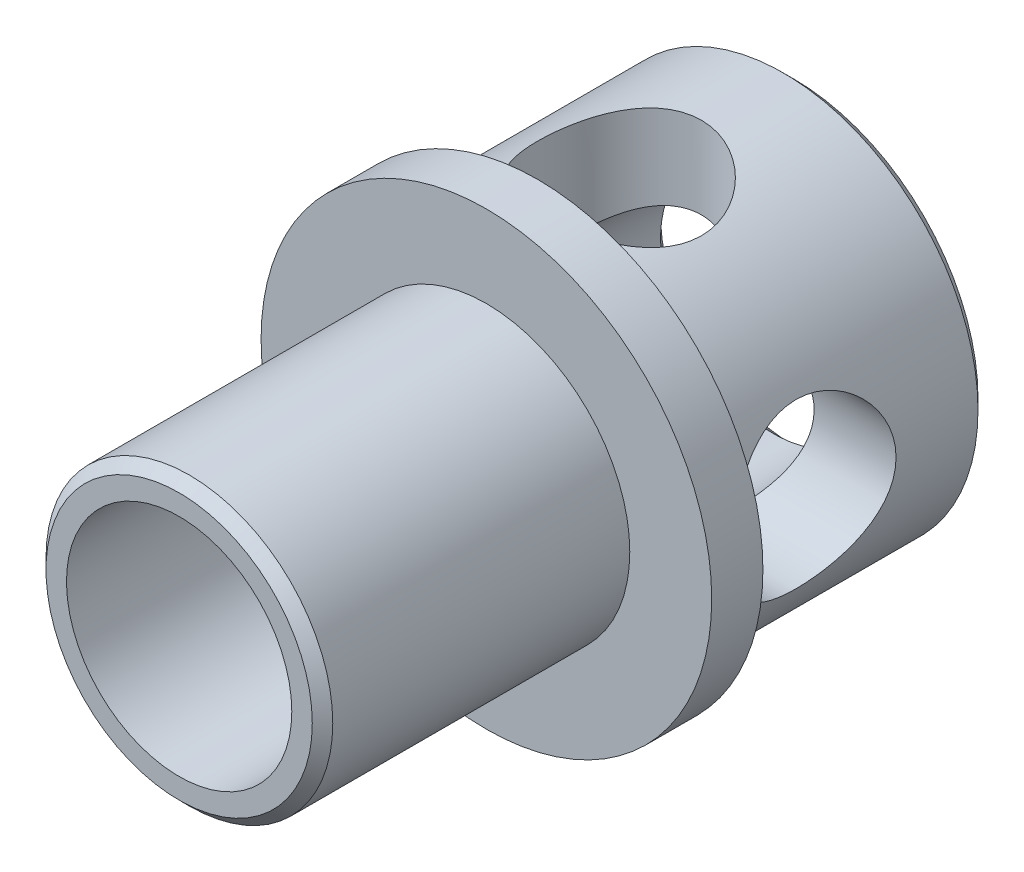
ISO-10303-21;
HEADER;
FILE_DESCRIPTION(('STEP AP214'),'2;1');
FILE_NAME('part.step','',(''),(''),'','','');
FILE_SCHEMA(('AUTOMOTIVE_DESIGN { 1 0 10303 214 1 1 1 1 }'));
ENDSEC;
DATA;
#1=APPLICATION_CONTEXT('core data for automotive mechanical design processes');
#2=APPLICATION_PROTOCOL_DEFINITION('international standard','automotive_design',2000,#1);
#3=PRODUCT_CONTEXT('',#1,'mechanical');
#4=PRODUCT('Part','Part','',(#3));
#5=PRODUCT_RELATED_PRODUCT_CATEGORY('part','',(#4));
#6=PRODUCT_DEFINITION_FORMATION('','',#4);
#7=PRODUCT_DEFINITION_CONTEXT('part definition',#1,'design');
#8=PRODUCT_DEFINITION('design','',#6,#7);
#9=PRODUCT_DEFINITION_SHAPE('','',#8);
#10=(LENGTH_UNIT() NAMED_UNIT(*) SI_UNIT(.MILLI.,.METRE.));
#11=(NAMED_UNIT(*) PLANE_ANGLE_UNIT() SI_UNIT($,.RADIAN.));
#12=(NAMED_UNIT(*) SI_UNIT($,.STERADIAN.) SOLID_ANGLE_UNIT());
#13=UNCERTAINTY_MEASURE_WITH_UNIT(LENGTH_MEASURE(1.E-05),#10,'distance_accuracy_value','');
#14=(GEOMETRIC_REPRESENTATION_CONTEXT(3) GLOBAL_UNCERTAINTY_ASSIGNED_CONTEXT((#13)) GLOBAL_UNIT_ASSIGNED_CONTEXT((#10,
#11,#12)) REPRESENTATION_CONTEXT('',''));
#15=CARTESIAN_POINT('',(0.,0.,0.));
#16=DIRECTION('',(0.,0.,1.));
#17=DIRECTION('',(1.,0.,0.));
#18=AXIS2_PLACEMENT_3D('',#15,#16,#17);
#19=CARTESIAN_POINT('',(0.,0.,30.));
#20=DIRECTION('',(0.,0.,-1.));
#21=DIRECTION('',(-1.,0.,0.));
#22=AXIS2_PLACEMENT_3D('',#19,#20,#21);
#23=CYLINDRICAL_SURFACE('',#22,5.5);
#24=CARTESIAN_POINT('',(0.,-5.5,12.5));
#25=CARTESIAN_POINT('',(0.0984084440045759,-5.49999903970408,12.4999989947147));
#26=CARTESIAN_POINT('',(0.196846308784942,-5.49735205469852,12.4963615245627));
#27=CARTESIAN_POINT('',(0.392949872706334,-5.48682476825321,12.4818676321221));
#28=CARTESIAN_POINT('',(0.490615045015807,-5.47894116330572,12.4710066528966));
#29=CARTESIAN_POINT('',(0.684555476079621,-5.45810479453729,12.4422085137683));
#30=CARTESIAN_POINT('',(0.780827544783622,-5.44514186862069,12.4242571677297));
#31=CARTESIAN_POINT('',(0.971092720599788,-5.41445183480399,12.3815595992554));
#32=CARTESIAN_POINT('',(1.0650847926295,-5.39672260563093,12.3568103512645));
#33=CARTESIAN_POINT('',(1.34149727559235,-5.33719436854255,12.2732210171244));
#34=CARTESIAN_POINT('',(1.51974308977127,-5.28889729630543,12.2048263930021));
#35=CARTESIAN_POINT('',(1.86104833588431,-5.17868357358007,12.0457080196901));
#36=CARTESIAN_POINT('',(2.02411279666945,-5.11677145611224,11.9549917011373));
#37=CARTESIAN_POINT('',(2.34745196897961,-4.97726899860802,11.7449861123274));
#38=CARTESIAN_POINT('',(2.50612448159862,-4.89876490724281,11.6238486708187));
#39=CARTESIAN_POINT('',(2.80234464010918,-4.735556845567,11.3611455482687));
#40=CARTESIAN_POINT('',(2.93985815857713,-4.65084317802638,11.2195475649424));
#41=CARTESIAN_POINT('',(3.14142944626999,-4.51549142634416,10.9789402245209));
#42=CARTESIAN_POINT('',(3.21271520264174,-4.46491683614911,10.8858432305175));
#43=CARTESIAN_POINT('',(3.34716368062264,-4.36503158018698,10.6932384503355));
#44=CARTESIAN_POINT('',(3.41032409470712,-4.31572127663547,10.5937288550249));
#45=CARTESIAN_POINT('',(3.52805237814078,-4.22002309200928,10.3885986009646));
#46=CARTESIAN_POINT('',(3.58263175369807,-4.17363134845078,10.2829863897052));
#47=CARTESIAN_POINT('',(3.68277103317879,-4.08554066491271,10.0657331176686));
#48=CARTESIAN_POINT('',(3.72833246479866,-4.04384093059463,9.95409308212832));
#49=CARTESIAN_POINT('',(3.82361059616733,-3.95419172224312,9.68594942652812));
#50=CARTESIAN_POINT('',(3.86948259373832,-3.90893007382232,9.52708689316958));
#51=CARTESIAN_POINT('',(3.92354368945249,-3.85440723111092,9.28279639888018));
#52=CARTESIAN_POINT('',(3.93910176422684,-3.83846627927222,9.20041335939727));
#53=CARTESIAN_POINT('',(3.96508247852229,-3.81162335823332,9.03403852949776));
#54=CARTESIAN_POINT('',(3.97550720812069,-3.80071933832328,8.95004740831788));
#55=CARTESIAN_POINT('',(3.99107685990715,-3.78436723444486,8.78038994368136));
#56=CARTESIAN_POINT('',(3.99618070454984,-3.77896160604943,8.69471569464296));
#57=CARTESIAN_POINT('',(4.00085496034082,-3.77401268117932,8.52304696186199));
#58=CARTESIAN_POINT('',(4.00042557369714,-3.7744691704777,8.43705248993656));
#59=CARTESIAN_POINT('',(3.9940415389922,-3.78122375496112,8.2654654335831));
#60=CARTESIAN_POINT('',(3.98808451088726,-3.78752436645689,8.17987303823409));
#61=CARTESIAN_POINT('',(3.97077015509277,-3.80567208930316,8.00979837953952));
#62=CARTESIAN_POINT('',(3.95941003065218,-3.81752207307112,7.92531671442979));
#63=CARTESIAN_POINT('',(3.9299073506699,-3.84789873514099,7.74849885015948));
#64=CARTESIAN_POINT('',(3.91113665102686,-3.86703500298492,7.65637223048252));
#65=CARTESIAN_POINT('',(3.86752833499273,-3.91064916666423,7.47483911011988));
#66=CARTESIAN_POINT('',(3.84268664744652,-3.93513064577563,7.38543448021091));
#67=CARTESIAN_POINT('',(3.75954096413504,-4.01518937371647,7.1216474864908));
#68=CARTESIAN_POINT('',(3.69264874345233,-4.07734524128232,6.95187919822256));
#69=CARTESIAN_POINT('',(3.5642123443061,-4.18940076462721,6.68040877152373));
#70=CARTESIAN_POINT('',(3.50823146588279,-4.23654386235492,6.57478209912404));
#71=CARTESIAN_POINT('',(3.38767435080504,-4.3335484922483,6.36979154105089));
#72=CARTESIAN_POINT('',(3.32309579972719,-4.38341075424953,6.27042935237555));
#73=CARTESIAN_POINT('',(3.18565928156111,-4.48428947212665,6.0781077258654));
#74=CARTESIAN_POINT('',(3.11279435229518,-4.53530686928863,5.98515377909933));
#75=CARTESIAN_POINT('',(2.95905843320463,-4.63707579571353,5.80594962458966));
#76=CARTESIAN_POINT('',(2.87818712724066,-4.68782731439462,5.71969968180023));
#77=CARTESIAN_POINT('',(2.7075521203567,-4.78843347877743,5.55321386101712));
#78=CARTESIAN_POINT('',(2.61768838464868,-4.83826850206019,5.47306844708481));
#79=CARTESIAN_POINT('',(2.43017835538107,-4.93511583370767,5.32056052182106));
#80=CARTESIAN_POINT('',(2.33253311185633,-4.98212852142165,5.24819696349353));
#81=CARTESIAN_POINT('',(2.12992764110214,-5.07204693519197,5.11204068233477));
#82=CARTESIAN_POINT('',(2.02498109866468,-5.11496000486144,5.04823254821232));
#83=CARTESIAN_POINT('',(1.80816162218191,-5.19556941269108,4.92987191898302));
#84=CARTESIAN_POINT('',(1.69629131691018,-5.23326771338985,4.87531594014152));
#85=CARTESIAN_POINT('',(1.41021717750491,-5.31912327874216,4.75221715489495));
#86=CARTESIAN_POINT('',(1.23214464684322,-5.36345823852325,4.68976440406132));
#87=CARTESIAN_POINT('',(0.865776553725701,-5.43463079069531,4.59021443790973));
#88=CARTESIAN_POINT('',(0.677488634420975,-5.46148127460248,4.55309854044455));
#89=CARTESIAN_POINT('',(0.295007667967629,-5.4954458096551,4.50623075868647));
#90=CARTESIAN_POINT('',(0.10079562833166,-5.50248769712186,4.49657892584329));
#91=CARTESIAN_POINT('',(-0.286621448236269,-5.49594258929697,4.50557956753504));
#92=CARTESIAN_POINT('',(-0.479826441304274,-5.48235470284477,4.52423326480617));
#93=CARTESIAN_POINT('',(-0.848454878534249,-5.43715890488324,4.58680099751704));
#94=CARTESIAN_POINT('',(-1.02426702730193,-5.40660857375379,4.62923377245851));
#95=CARTESIAN_POINT('',(-1.36562564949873,-5.33063562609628,4.73608136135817));
#96=CARTESIAN_POINT('',(-1.53116998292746,-5.2852099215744,4.80050073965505));
#97=CARTESIAN_POINT('',(-1.86254817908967,-5.17819647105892,4.95499135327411));
#98=CARTESIAN_POINT('',(-2.02725211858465,-5.11557595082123,5.04675530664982));
#99=CARTESIAN_POINT('',(-2.33947109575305,-4.98054847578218,5.25013135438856));
#100=CARTESIAN_POINT('',(-2.48697454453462,-4.90813499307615,5.36175670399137));
#101=CARTESIAN_POINT('',(-2.78904311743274,-4.74403863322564,5.62452792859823));
#102=CARTESIAN_POINT('',(-2.93996918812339,-4.65125321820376,5.77916807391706));
#103=CARTESIAN_POINT('',(-3.21520511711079,-4.46542541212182,6.11066271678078));
#104=CARTESIAN_POINT('',(-3.33949353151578,-4.37238287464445,6.28753493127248));
#105=CARTESIAN_POINT('',(-3.54628148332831,-4.20586816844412,6.63977727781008));
#106=CARTESIAN_POINT('',(-3.63201008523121,-4.13138834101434,6.8127664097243));
#107=CARTESIAN_POINT('',(-3.77892413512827,-3.99745252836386,7.17425257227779));
#108=CARTESIAN_POINT('',(-3.84016090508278,-3.93796522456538,7.36271616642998));
#109=CARTESIAN_POINT('',(-3.92447442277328,-3.85373689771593,7.71054640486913));
#110=CARTESIAN_POINT('',(-3.9529301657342,-3.82427115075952,7.86743397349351));
#111=CARTESIAN_POINT('',(-3.99085072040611,-3.78469363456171,8.18581080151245));
#112=CARTESIAN_POINT('',(-4.00034270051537,-3.77455417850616,8.34729314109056));
#113=CARTESIAN_POINT('',(-3.9996377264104,-3.77530099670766,8.67040511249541));
#114=CARTESIAN_POINT('',(-3.98941138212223,-3.786218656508,8.83203460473));
#115=CARTESIAN_POINT('',(-3.95001664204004,-3.82728792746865,9.15055529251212));
#116=CARTESIAN_POINT('',(-3.92081835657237,-3.85746988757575,9.3074386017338));
#117=CARTESIAN_POINT('',(-3.83369579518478,-3.94430870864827,9.65974890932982));
#118=CARTESIAN_POINT('',(-3.76972865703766,-4.00623096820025,9.85235018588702));
#119=CARTESIAN_POINT('',(-3.61630704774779,-4.14523984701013,10.221161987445));
#120=CARTESIAN_POINT('',(-3.52680959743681,-4.2223519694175,10.3973442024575));
#121=CARTESIAN_POINT('',(-3.32181769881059,-4.38556998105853,10.7374274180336));
#122=CARTESIAN_POINT('',(-3.20563731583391,-4.47187341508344,10.9008161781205));
#123=CARTESIAN_POINT('',(-2.95012732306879,-4.64440662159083,11.2086418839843));
#124=CARTESIAN_POINT('',(-2.81078817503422,-4.73063634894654,11.3530709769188));
#125=CARTESIAN_POINT('',(-2.56887263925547,-4.86434742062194,11.5685378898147));
#126=CARTESIAN_POINT('',(-2.47320695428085,-4.91380339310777,11.6462007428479));
#127=CARTESIAN_POINT('',(-2.27388986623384,-5.00915341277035,11.7931370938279));
#128=CARTESIAN_POINT('',(-2.17023667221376,-5.05504665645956,11.8624087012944));
#129=CARTESIAN_POINT('',(-1.9554993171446,-5.14192851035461,11.9916632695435));
#130=CARTESIAN_POINT('',(-1.84442265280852,-5.18292195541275,12.0516554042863));
#131=CARTESIAN_POINT('',(-1.61540436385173,-5.25880189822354,12.1614990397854));
#132=CARTESIAN_POINT('',(-1.49746635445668,-5.29369157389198,12.2113558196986));
#133=CARTESIAN_POINT('',(-1.29007572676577,-5.34730754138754,12.2873737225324));
#134=CARTESIAN_POINT('',(-1.20206275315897,-5.36780854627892,12.3162411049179));
#135=CARTESIAN_POINT('',(-1.02345557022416,-5.40470593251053,12.3679679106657));
#136=CARTESIAN_POINT('',(-0.932861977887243,-5.42110328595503,12.3908287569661));
#137=CARTESIAN_POINT('',(-0.749865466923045,-5.44942698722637,12.4301960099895));
#138=CARTESIAN_POINT('',(-0.657467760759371,-5.46136464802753,12.4467184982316));
#139=CARTESIAN_POINT('',(-0.471295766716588,-5.48056812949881,12.4732494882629));
#140=CARTESIAN_POINT('',(-0.377522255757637,-5.48783649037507,12.4832615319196));
#141=CARTESIAN_POINT('',(-0.236296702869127,-5.49512453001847,12.4932941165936));
#142=CARTESIAN_POINT('',(-0.189097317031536,-5.49695146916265,12.4958074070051));
#143=CARTESIAN_POINT('',(-0.094600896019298,-5.4993895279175,12.4991607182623));
#144=CARTESIAN_POINT('',(-0.0473038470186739,-5.50000046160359,12.5000004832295));
#145=CARTESIAN_POINT('',(0.,-5.5,12.5));
#146=B_SPLINE_CURVE_WITH_KNOTS('',3,(#24,#25,#26,#27,#28,#29,#30,#31,#32,#33,#34,#35,#36,#37,
#38,#39,#40,#41,#42,#43,#44,#45,#46,#47,#48,#49,#50,#51,#52,#53,#54,#55,#56,#57,#58,#59,#60,#61,
#62,#63,#64,#65,#66,#67,#68,#69,#70,#71,#72,#73,#74,#75,#76,#77,#78,#79,#80,#81,#82,#83,#84,#85,
#86,#87,#88,#89,#90,#91,#92,#93,#94,#95,#96,#97,#98,#99,#100,#101,#102,#103,#104,#105,#106,#107,
#108,#109,#110,#111,#112,#113,#114,#115,#116,#117,#118,#119,#120,#121,#122,#123,#124,#125,#126,
#127,#128,#129,#130,#131,#132,#133,#134,#135,#136,#137,#138,#139,#140,#141,#142,#143,#144,#145),
.UNSPECIFIED.,.T.,.F.,(4,2,2,2,2,2,2,2,2,2,2,2,2,2,2,2,2,2,2,2,2,2,2,2,2,2,2,2,2,2,2,2,2,2,2,2,
2,2,2,2,2,2,2,2,2,2,2,2,2,2,2,2,2,2,2,2,2,2,2,2,4),(0.,0.295173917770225,0.590534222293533,
0.886488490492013,1.18257469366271,1.77055979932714,2.35834943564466,2.99959161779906,
3.64185745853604,4.02458431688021,4.40741962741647,4.78973713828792,5.1719898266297,
5.68407429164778,5.93983762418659,6.19549673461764,6.45311525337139,6.71072435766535,
6.96844443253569,7.22629805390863,7.51370613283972,7.80130747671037,8.37708279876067,
8.76220665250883,9.14743438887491,9.53298821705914,9.91855727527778,10.3090312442,
10.6994526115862,11.0891609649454,11.4787222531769,12.0576277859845,12.6361059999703,
13.2166889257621,13.7972969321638,14.3452171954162,14.8932512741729,15.4870438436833,
16.0812341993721,16.7840549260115,17.4874393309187,18.1061725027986,18.7236022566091,
19.2080094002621,19.6917220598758,20.1761562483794,20.6613555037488,21.2944341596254,
21.9285849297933,22.5813485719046,23.2343817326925,23.6322360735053,24.0301798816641,
24.4277277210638,24.8250679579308,25.1093874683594,25.3936395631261,25.6771656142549,
25.9605372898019,26.1024024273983,26.244289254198),.UNSPECIFIED.);
#147=CARTESIAN_POINT('',(3.88908729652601,-3.88908729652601,7.56458565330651));
#148=VERTEX_POINT('',#147);
#149=CARTESIAN_POINT('',(-3.88908729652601,-3.88908729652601,7.56458565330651));
#150=VERTEX_POINT('',#149);
#151=EDGE_CURVE('E80',#148,#150,#146,.T.);
#152=ORIENTED_EDGE('',*,*,#151,.F.);
#153=CARTESIAN_POINT('',(5.5,0.,4.5));
#154=CARTESIAN_POINT('',(5.49999903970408,-0.098408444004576,4.50000100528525));
#155=CARTESIAN_POINT('',(5.49735205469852,-0.196846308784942,4.5036384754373));
#156=CARTESIAN_POINT('',(5.48682476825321,-0.392949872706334,4.51813236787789));
#157=CARTESIAN_POINT('',(5.47894116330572,-0.490615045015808,4.52899334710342));
#158=CARTESIAN_POINT('',(5.45810479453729,-0.684555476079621,4.55779148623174));
#159=CARTESIAN_POINT('',(5.44514186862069,-0.780827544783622,4.57574283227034));
#160=CARTESIAN_POINT('',(5.41445183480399,-0.971092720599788,4.61844040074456));
#161=CARTESIAN_POINT('',(5.39672260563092,-1.0650847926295,4.64318964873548));
#162=CARTESIAN_POINT('',(5.33719436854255,-1.34149727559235,4.72677898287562));
#163=CARTESIAN_POINT('',(5.28889729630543,-1.51974308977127,4.7951736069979));
#164=CARTESIAN_POINT('',(5.17868357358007,-1.86104833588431,4.95429198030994));
#165=CARTESIAN_POINT('',(5.11677145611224,-2.02411279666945,5.04500829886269));
#166=CARTESIAN_POINT('',(4.97726899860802,-2.34745196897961,5.25501388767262));
#167=CARTESIAN_POINT('',(4.89876490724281,-2.50612448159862,5.37615132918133));
#168=CARTESIAN_POINT('',(4.735556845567,-2.80234464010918,5.63885445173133));
#169=CARTESIAN_POINT('',(4.65084317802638,-2.93985815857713,5.78045243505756));
#170=CARTESIAN_POINT('',(4.51549142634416,-3.14142944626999,6.02105977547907));
#171=CARTESIAN_POINT('',(4.46491683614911,-3.21271520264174,6.11415676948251));
#172=CARTESIAN_POINT('',(4.36503158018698,-3.34716368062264,6.3067615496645));
#173=CARTESIAN_POINT('',(4.31572127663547,-3.41032409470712,6.40627114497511));
#174=CARTESIAN_POINT('',(4.22002309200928,-3.52805237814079,6.61140139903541));
#175=CARTESIAN_POINT('',(4.17363134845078,-3.58263175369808,6.71701361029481));
#176=CARTESIAN_POINT('',(4.08554066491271,-3.68277103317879,6.93426688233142));
#177=CARTESIAN_POINT('',(4.04384093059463,-3.72833246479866,7.04590691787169));
#178=CARTESIAN_POINT('',(3.95419172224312,-3.82361059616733,7.31405057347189));
#179=CARTESIAN_POINT('',(3.90893007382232,-3.86948259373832,7.47291310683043));
#180=CARTESIAN_POINT('',(3.85440723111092,-3.9235436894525,7.71720360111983));
#181=CARTESIAN_POINT('',(3.83846627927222,-3.93910176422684,7.79958664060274));
#182=CARTESIAN_POINT('',(3.81162335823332,-3.96508247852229,7.96596147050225));
#183=CARTESIAN_POINT('',(3.80071933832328,-3.97550720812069,8.04995259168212));
#184=CARTESIAN_POINT('',(3.78436723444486,-3.99107685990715,8.21961005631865));
#185=CARTESIAN_POINT('',(3.77896160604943,-3.99618070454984,8.30528430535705));
#186=CARTESIAN_POINT('',(3.77401268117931,-4.00085496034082,8.47695303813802));
#187=CARTESIAN_POINT('',(3.77446917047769,-4.00042557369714,8.56294751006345));
#188=CARTESIAN_POINT('',(3.78122375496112,-3.9940415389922,8.7345345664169));
#189=CARTESIAN_POINT('',(3.78752436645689,-3.98808451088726,8.82012696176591));
#190=CARTESIAN_POINT('',(3.80567208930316,-3.97077015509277,8.99020162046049));
#191=CARTESIAN_POINT('',(3.81752207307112,-3.95941003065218,9.07468328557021));
#192=CARTESIAN_POINT('',(3.84789873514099,-3.9299073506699,9.25150114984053));
#193=CARTESIAN_POINT('',(3.86703500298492,-3.91113665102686,9.34362776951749));
#194=CARTESIAN_POINT('',(3.91064916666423,-3.86752833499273,9.52516088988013));
#195=CARTESIAN_POINT('',(3.93513064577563,-3.84268664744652,9.6145655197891));
#196=CARTESIAN_POINT('',(4.01518937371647,-3.75954096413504,9.87835251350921));
#197=CARTESIAN_POINT('',(4.07734524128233,-3.69264874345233,10.0481208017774));
#198=CARTESIAN_POINT('',(4.18940076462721,-3.5642123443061,10.3195912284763));
#199=CARTESIAN_POINT('',(4.23654386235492,-3.50823146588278,10.425217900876));
#200=CARTESIAN_POINT('',(4.3335484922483,-3.38767435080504,10.6302084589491));
#201=CARTESIAN_POINT('',(4.38341075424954,-3.32309579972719,10.7295706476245));
#202=CARTESIAN_POINT('',(4.48428947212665,-3.18565928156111,10.9218922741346));
#203=CARTESIAN_POINT('',(4.53530686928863,-3.11279435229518,11.0148462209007));
#204=CARTESIAN_POINT('',(4.63707579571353,-2.95905843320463,11.1940503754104));
#205=CARTESIAN_POINT('',(4.68782731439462,-2.87818712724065,11.2803003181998));
#206=CARTESIAN_POINT('',(4.78843347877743,-2.70755212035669,11.4467861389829));
#207=CARTESIAN_POINT('',(4.83826850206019,-2.61768838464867,11.5269315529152));
#208=CARTESIAN_POINT('',(4.93511583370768,-2.43017835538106,11.679439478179));
#209=CARTESIAN_POINT('',(4.98212852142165,-2.33253311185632,11.7518030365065));
#210=CARTESIAN_POINT('',(5.07204693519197,-2.12992764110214,11.8879593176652));
#211=CARTESIAN_POINT('',(5.11496000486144,-2.02498109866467,11.9517674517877));
#212=CARTESIAN_POINT('',(5.19556941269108,-1.8081616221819,12.070128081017));
#213=CARTESIAN_POINT('',(5.23326771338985,-1.69629131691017,12.1246840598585));
#214=CARTESIAN_POINT('',(5.31912327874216,-1.4102171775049,12.2477828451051));
#215=CARTESIAN_POINT('',(5.36345823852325,-1.23214464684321,12.3102355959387));
#216=CARTESIAN_POINT('',(5.43463079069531,-0.865776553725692,12.4097855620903));
#217=CARTESIAN_POINT('',(5.46148127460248,-0.677488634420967,12.4469014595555));
#218=CARTESIAN_POINT('',(5.4954458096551,-0.295007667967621,12.4937692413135));
#219=CARTESIAN_POINT('',(5.50248769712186,-0.100795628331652,12.5034210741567));
#220=CARTESIAN_POINT('',(5.49594258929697,0.286621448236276,12.494420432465));
#221=CARTESIAN_POINT('',(5.48235470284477,0.479826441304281,12.4757667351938));
#222=CARTESIAN_POINT('',(5.43715890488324,0.848454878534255,12.413199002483));
#223=CARTESIAN_POINT('',(5.40660857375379,1.02426702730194,12.3707662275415));
#224=CARTESIAN_POINT('',(5.33063562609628,1.36562564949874,12.2639186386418));
#225=CARTESIAN_POINT('',(5.2852099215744,1.53116998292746,12.199499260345));
#226=CARTESIAN_POINT('',(5.17819647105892,1.86254817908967,12.0450086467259));
#227=CARTESIAN_POINT('',(5.11557595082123,2.02725211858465,11.9532446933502));
#228=CARTESIAN_POINT('',(4.98054847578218,2.33947109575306,11.7498686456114));
#229=CARTESIAN_POINT('',(4.90813499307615,2.48697454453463,11.6382432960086));
#230=CARTESIAN_POINT('',(4.74403863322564,2.78904311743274,11.3754720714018));
#231=CARTESIAN_POINT('',(4.65125321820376,2.9399691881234,11.2208319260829));
#232=CARTESIAN_POINT('',(4.46542541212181,3.21520511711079,10.8893372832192));
#233=CARTESIAN_POINT('',(4.37238287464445,3.33949353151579,10.7124650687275));
#234=CARTESIAN_POINT('',(4.20586816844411,3.54628148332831,10.3602227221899));
#235=CARTESIAN_POINT('',(4.13138834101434,3.63201008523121,10.1872335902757));
#236=CARTESIAN_POINT('',(3.99745252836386,3.77892413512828,9.82574742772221));
#237=CARTESIAN_POINT('',(3.93796522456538,3.84016090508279,9.63728383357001));
#238=CARTESIAN_POINT('',(3.85373689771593,3.92447442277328,9.28945359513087));
#239=CARTESIAN_POINT('',(3.82427115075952,3.95293016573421,9.1325660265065));
#240=CARTESIAN_POINT('',(3.78469363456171,3.99085072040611,8.81418919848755));
#241=CARTESIAN_POINT('',(3.77455417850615,4.00034270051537,8.65270685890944));
#242=CARTESIAN_POINT('',(3.77530099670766,3.9996377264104,8.3295948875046));
#243=CARTESIAN_POINT('',(3.786218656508,3.98941138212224,8.16796539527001));
#244=CARTESIAN_POINT('',(3.82728792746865,3.95001664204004,7.84944470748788));
#245=CARTESIAN_POINT('',(3.85746988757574,3.92081835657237,7.6925613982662));
#246=CARTESIAN_POINT('',(3.94430870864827,3.83369579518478,7.34025109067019));
#247=CARTESIAN_POINT('',(4.00623096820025,3.76972865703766,7.14764981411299));
#248=CARTESIAN_POINT('',(4.14523984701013,3.61630704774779,6.77883801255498));
#249=CARTESIAN_POINT('',(4.2223519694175,3.52680959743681,6.60265579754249));
#250=CARTESIAN_POINT('',(4.38556998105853,3.32181769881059,6.26257258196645));
#251=CARTESIAN_POINT('',(4.47187341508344,3.20563731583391,6.09918382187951));
#252=CARTESIAN_POINT('',(4.64440662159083,2.95012732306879,5.79135811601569));
#253=CARTESIAN_POINT('',(4.73063634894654,2.81078817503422,5.64692902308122));
#254=CARTESIAN_POINT('',(4.86434742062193,2.56887263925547,5.43146211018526));
#255=CARTESIAN_POINT('',(4.91380339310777,2.47320695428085,5.35379925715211));
#256=CARTESIAN_POINT('',(5.00915341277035,2.27388986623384,5.20686290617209));
#257=CARTESIAN_POINT('',(5.05504665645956,2.17023667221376,5.1375912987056));
#258=CARTESIAN_POINT('',(5.14192851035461,1.9554993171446,5.00833673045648));
#259=CARTESIAN_POINT('',(5.18292195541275,1.84442265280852,4.94834459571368));
#260=CARTESIAN_POINT('',(5.25880189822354,1.61540436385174,4.83850096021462));
#261=CARTESIAN_POINT('',(5.29369157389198,1.49746635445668,4.78864418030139));
#262=CARTESIAN_POINT('',(5.34730754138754,1.29007572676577,4.71262627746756));
#263=CARTESIAN_POINT('',(5.36780854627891,1.20206275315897,4.68375889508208));
#264=CARTESIAN_POINT('',(5.40470593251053,1.02345557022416,4.63203208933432));
#265=CARTESIAN_POINT('',(5.42110328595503,0.932861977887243,4.60917124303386));
#266=CARTESIAN_POINT('',(5.44942698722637,0.749865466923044,4.56980399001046));
#267=CARTESIAN_POINT('',(5.46136464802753,0.657467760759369,4.55328150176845));
#268=CARTESIAN_POINT('',(5.48056812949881,0.471295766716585,4.52675051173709));
#269=CARTESIAN_POINT('',(5.48783649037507,0.377522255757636,4.51673846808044));
#270=CARTESIAN_POINT('',(5.49512453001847,0.236296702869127,4.5067058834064));
#271=CARTESIAN_POINT('',(5.49695146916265,0.189097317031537,4.50419259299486));
#272=CARTESIAN_POINT('',(5.4993895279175,0.094600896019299,4.50083928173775));
#273=CARTESIAN_POINT('',(5.50000046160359,0.0473038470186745,4.49999951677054));
#274=CARTESIAN_POINT('',(5.5,0.,4.5));
#275=B_SPLINE_CURVE_WITH_KNOTS('',3,(#153,#154,#155,#156,#157,#158,#159,#160,#161,#162,#163,
#164,#165,#166,#167,#168,#169,#170,#171,#172,#173,#174,#175,#176,#177,#178,#179,#180,#181,#182,
#183,#184,#185,#186,#187,#188,#189,#190,#191,#192,#193,#194,#195,#196,#197,#198,#199,#200,#201,
#202,#203,#204,#205,#206,#207,#208,#209,#210,#211,#212,#213,#214,#215,#216,#217,#218,#219,#220,
#221,#222,#223,#224,#225,#226,#227,#228,#229,#230,#231,#232,#233,#234,#235,#236,#237,#238,#239,
#240,#241,#242,#243,#244,#245,#246,#247,#248,#249,#250,#251,#252,#253,#254,#255,#256,#257,#258,
#259,#260,#261,#262,#263,#264,#265,#266,#267,#268,#269,#270,#271,#272,#273,#274),.UNSPECIFIED.,
.T.,.F.,(4,2,2,2,2,2,2,2,2,2,2,2,2,2,2,2,2,2,2,2,2,2,2,2,2,2,2,2,2,2,2,2,2,2,2,2,2,2,2,2,2,2,2,
2,2,2,2,2,2,2,2,2,2,2,2,2,2,2,2,2,4),(0.,0.295173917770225,0.590534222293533,0.886488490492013,
1.18257469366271,1.77055979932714,2.35834943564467,2.99959161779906,3.64185745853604,
4.02458431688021,4.40741962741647,4.78973713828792,5.1719898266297,5.68407429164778,
5.9398376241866,6.19549673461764,6.45311525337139,6.71072435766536,6.96844443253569,
7.22629805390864,7.51370613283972,7.80130747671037,8.37708279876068,8.76220665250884,
9.14743438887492,9.53298821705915,9.91855727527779,10.3090312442,10.6994526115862,
11.0891609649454,11.4787222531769,12.0576277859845,12.6361059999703,13.2166889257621,
13.7972969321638,14.3452171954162,14.8932512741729,15.4870438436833,16.0812341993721,
16.7840549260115,17.4874393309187,18.1061725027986,18.7236022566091,19.2080094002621,
19.6917220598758,20.1761562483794,20.6613555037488,21.2944341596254,21.9285849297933,
22.5813485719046,23.2343817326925,23.6322360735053,24.0301798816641,24.4277277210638,
24.8250679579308,25.1093874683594,25.3936395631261,25.6771656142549,25.9605372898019,
26.1024024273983,26.244289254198),.UNSPECIFIED.);
#276=CARTESIAN_POINT('',(3.88908729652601,3.88908729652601,7.56458565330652));
#277=VERTEX_POINT('',#276);
#278=EDGE_CURVE('E101',#277,#148,#275,.T.);
#279=ORIENTED_EDGE('',*,*,#278,.F.);
#280=CARTESIAN_POINT('',(0.,5.5,12.5));
#281=CARTESIAN_POINT('',(-0.0984084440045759,5.49999903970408,12.4999989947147));
#282=CARTESIAN_POINT('',(-0.196846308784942,5.49735205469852,12.4963615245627));
#283=CARTESIAN_POINT('',(-0.392949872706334,5.48682476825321,12.4818676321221));
#284=CARTESIAN_POINT('',(-0.490615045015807,5.47894116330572,12.4710066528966));
#285=CARTESIAN_POINT('',(-0.684555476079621,5.45810479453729,12.4422085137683));
#286=CARTESIAN_POINT('',(-0.780827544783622,5.44514186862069,12.4242571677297));
#287=CARTESIAN_POINT('',(-0.971092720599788,5.41445183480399,12.3815595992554));
#288=CARTESIAN_POINT('',(-1.0650847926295,5.39672260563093,12.3568103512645));
#289=CARTESIAN_POINT('',(-1.34149727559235,5.33719436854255,12.2732210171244));
#290=CARTESIAN_POINT('',(-1.51974308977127,5.28889729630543,12.2048263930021));
#291=CARTESIAN_POINT('',(-1.86104833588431,5.17868357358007,12.0457080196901));
#292=CARTESIAN_POINT('',(-2.02411279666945,5.11677145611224,11.9549917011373));
#293=CARTESIAN_POINT('',(-2.34745196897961,4.97726899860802,11.7449861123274));
#294=CARTESIAN_POINT('',(-2.50612448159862,4.89876490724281,11.6238486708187));
#295=CARTESIAN_POINT('',(-2.80234464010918,4.735556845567,11.3611455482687));
#296=CARTESIAN_POINT('',(-2.93985815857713,4.65084317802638,11.2195475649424));
#297=CARTESIAN_POINT('',(-3.14142944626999,4.51549142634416,10.9789402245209));
#298=CARTESIAN_POINT('',(-3.21271520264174,4.46491683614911,10.8858432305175));
#299=CARTESIAN_POINT('',(-3.34716368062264,4.36503158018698,10.6932384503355));
#300=CARTESIAN_POINT('',(-3.41032409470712,4.31572127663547,10.5937288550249));
#301=CARTESIAN_POINT('',(-3.52805237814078,4.22002309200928,10.3885986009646));
#302=CARTESIAN_POINT('',(-3.58263175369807,4.17363134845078,10.2829863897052));
#303=CARTESIAN_POINT('',(-3.68277103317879,4.08554066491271,10.0657331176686));
#304=CARTESIAN_POINT('',(-3.72833246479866,4.04384093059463,9.95409308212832));
#305=CARTESIAN_POINT('',(-3.82361059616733,3.95419172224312,9.68594942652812));
#306=CARTESIAN_POINT('',(-3.86948259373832,3.90893007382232,9.52708689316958));
#307=CARTESIAN_POINT('',(-3.92354368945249,3.85440723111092,9.28279639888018));
#308=CARTESIAN_POINT('',(-3.93910176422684,3.83846627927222,9.20041335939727));
#309=CARTESIAN_POINT('',(-3.96508247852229,3.81162335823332,9.03403852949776));
#310=CARTESIAN_POINT('',(-3.97550720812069,3.80071933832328,8.95004740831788));
#311=CARTESIAN_POINT('',(-3.99107685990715,3.78436723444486,8.78038994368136));
#312=CARTESIAN_POINT('',(-3.99618070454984,3.77896160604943,8.69471569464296));
#313=CARTESIAN_POINT('',(-4.00085496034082,3.77401268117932,8.52304696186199));
#314=CARTESIAN_POINT('',(-4.00042557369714,3.7744691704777,8.43705248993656));
#315=CARTESIAN_POINT('',(-3.9940415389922,3.78122375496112,8.2654654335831));
#316=CARTESIAN_POINT('',(-3.98808451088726,3.78752436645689,8.17987303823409));
#317=CARTESIAN_POINT('',(-3.97077015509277,3.80567208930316,8.00979837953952));
#318=CARTESIAN_POINT('',(-3.95941003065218,3.81752207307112,7.92531671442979));
#319=CARTESIAN_POINT('',(-3.9299073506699,3.84789873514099,7.74849885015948));
#320=CARTESIAN_POINT('',(-3.91113665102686,3.86703500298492,7.65637223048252));
#321=CARTESIAN_POINT('',(-3.86752833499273,3.91064916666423,7.47483911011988));
#322=CARTESIAN_POINT('',(-3.84268664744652,3.93513064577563,7.38543448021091));
#323=CARTESIAN_POINT('',(-3.75954096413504,4.01518937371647,7.1216474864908));
#324=CARTESIAN_POINT('',(-3.69264874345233,4.07734524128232,6.95187919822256));
#325=CARTESIAN_POINT('',(-3.5642123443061,4.18940076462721,6.68040877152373));
#326=CARTESIAN_POINT('',(-3.50823146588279,4.23654386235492,6.57478209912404));
#327=CARTESIAN_POINT('',(-3.38767435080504,4.3335484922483,6.36979154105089));
#328=CARTESIAN_POINT('',(-3.32309579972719,4.38341075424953,6.27042935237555));
#329=CARTESIAN_POINT('',(-3.18565928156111,4.48428947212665,6.0781077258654));
#330=CARTESIAN_POINT('',(-3.11279435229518,4.53530686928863,5.98515377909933));
#331=CARTESIAN_POINT('',(-2.95905843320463,4.63707579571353,5.80594962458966));
#332=CARTESIAN_POINT('',(-2.87818712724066,4.68782731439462,5.71969968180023));
#333=CARTESIAN_POINT('',(-2.7075521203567,4.78843347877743,5.55321386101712));
#334=CARTESIAN_POINT('',(-2.61768838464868,4.83826850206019,5.47306844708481));
#335=CARTESIAN_POINT('',(-2.43017835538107,4.93511583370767,5.32056052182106));
#336=CARTESIAN_POINT('',(-2.33253311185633,4.98212852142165,5.24819696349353));
#337=CARTESIAN_POINT('',(-2.12992764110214,5.07204693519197,5.11204068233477));
#338=CARTESIAN_POINT('',(-2.02498109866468,5.11496000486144,5.04823254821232));
#339=CARTESIAN_POINT('',(-1.80816162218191,5.19556941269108,4.92987191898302));
#340=CARTESIAN_POINT('',(-1.69629131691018,5.23326771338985,4.87531594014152));
#341=CARTESIAN_POINT('',(-1.41021717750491,5.31912327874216,4.75221715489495));
#342=CARTESIAN_POINT('',(-1.23214464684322,5.36345823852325,4.68976440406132));
#343=CARTESIAN_POINT('',(-0.865776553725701,5.43463079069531,4.59021443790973));
#344=CARTESIAN_POINT('',(-0.677488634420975,5.46148127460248,4.55309854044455));
#345=CARTESIAN_POINT('',(-0.295007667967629,5.4954458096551,4.50623075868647));
#346=CARTESIAN_POINT('',(-0.10079562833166,5.50248769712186,4.49657892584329));
#347=CARTESIAN_POINT('',(0.286621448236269,5.49594258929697,4.50557956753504));
#348=CARTESIAN_POINT('',(0.479826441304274,5.48235470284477,4.52423326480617));
#349=CARTESIAN_POINT('',(0.848454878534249,5.43715890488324,4.58680099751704));
#350=CARTESIAN_POINT('',(1.02426702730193,5.40660857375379,4.62923377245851));
#351=CARTESIAN_POINT('',(1.36562564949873,5.33063562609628,4.73608136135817));
#352=CARTESIAN_POINT('',(1.53116998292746,5.2852099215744,4.80050073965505));
#353=CARTESIAN_POINT('',(1.86254817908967,5.17819647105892,4.95499135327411));
#354=CARTESIAN_POINT('',(2.02725211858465,5.11557595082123,5.04675530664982));
#355=CARTESIAN_POINT('',(2.33947109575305,4.98054847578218,5.25013135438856));
#356=CARTESIAN_POINT('',(2.48697454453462,4.90813499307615,5.36175670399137));
#357=CARTESIAN_POINT('',(2.78904311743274,4.74403863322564,5.62452792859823));
#358=CARTESIAN_POINT('',(2.93996918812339,4.65125321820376,5.77916807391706));
#359=CARTESIAN_POINT('',(3.21520511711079,4.46542541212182,6.11066271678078));
#360=CARTESIAN_POINT('',(3.33949353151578,4.37238287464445,6.28753493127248));
#361=CARTESIAN_POINT('',(3.54628148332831,4.20586816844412,6.63977727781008));
#362=CARTESIAN_POINT('',(3.63201008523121,4.13138834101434,6.8127664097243));
#363=CARTESIAN_POINT('',(3.77892413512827,3.99745252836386,7.17425257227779));
#364=CARTESIAN_POINT('',(3.84016090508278,3.93796522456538,7.36271616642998));
#365=CARTESIAN_POINT('',(3.92447442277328,3.85373689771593,7.71054640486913));
#366=CARTESIAN_POINT('',(3.9529301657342,3.82427115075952,7.86743397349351));
#367=CARTESIAN_POINT('',(3.99085072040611,3.78469363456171,8.18581080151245));
#368=CARTESIAN_POINT('',(4.00034270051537,3.77455417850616,8.34729314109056));
#369=CARTESIAN_POINT('',(3.9996377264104,3.77530099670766,8.67040511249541));
#370=CARTESIAN_POINT('',(3.98941138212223,3.786218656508,8.83203460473));
#371=CARTESIAN_POINT('',(3.95001664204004,3.82728792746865,9.15055529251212));
#372=CARTESIAN_POINT('',(3.92081835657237,3.85746988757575,9.3074386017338));
#373=CARTESIAN_POINT('',(3.83369579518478,3.94430870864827,9.65974890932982));
#374=CARTESIAN_POINT('',(3.76972865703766,4.00623096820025,9.85235018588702));
#375=CARTESIAN_POINT('',(3.61630704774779,4.14523984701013,10.221161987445));
#376=CARTESIAN_POINT('',(3.52680959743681,4.2223519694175,10.3973442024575));
#377=CARTESIAN_POINT('',(3.32181769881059,4.38556998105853,10.7374274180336));
#378=CARTESIAN_POINT('',(3.20563731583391,4.47187341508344,10.9008161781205));
#379=CARTESIAN_POINT('',(2.95012732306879,4.64440662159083,11.2086418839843));
#380=CARTESIAN_POINT('',(2.81078817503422,4.73063634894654,11.3530709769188));
#381=CARTESIAN_POINT('',(2.56887263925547,4.86434742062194,11.5685378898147));
#382=CARTESIAN_POINT('',(2.47320695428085,4.91380339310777,11.6462007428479));
#383=CARTESIAN_POINT('',(2.27388986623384,5.00915341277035,11.7931370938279));
#384=CARTESIAN_POINT('',(2.17023667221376,5.05504665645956,11.8624087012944));
#385=CARTESIAN_POINT('',(1.9554993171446,5.14192851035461,11.9916632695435));
#386=CARTESIAN_POINT('',(1.84442265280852,5.18292195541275,12.0516554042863));
#387=CARTESIAN_POINT('',(1.61540436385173,5.25880189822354,12.1614990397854));
#388=CARTESIAN_POINT('',(1.49746635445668,5.29369157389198,12.2113558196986));
#389=CARTESIAN_POINT('',(1.29007572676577,5.34730754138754,12.2873737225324));
#390=CARTESIAN_POINT('',(1.20206275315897,5.36780854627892,12.3162411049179));
#391=CARTESIAN_POINT('',(1.02345557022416,5.40470593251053,12.3679679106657));
#392=CARTESIAN_POINT('',(0.932861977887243,5.42110328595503,12.3908287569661));
#393=CARTESIAN_POINT('',(0.749865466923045,5.44942698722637,12.4301960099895));
#394=CARTESIAN_POINT('',(0.657467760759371,5.46136464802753,12.4467184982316));
#395=CARTESIAN_POINT('',(0.471295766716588,5.48056812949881,12.4732494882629));
#396=CARTESIAN_POINT('',(0.377522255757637,5.48783649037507,12.4832615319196));
#397=CARTESIAN_POINT('',(0.236296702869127,5.49512453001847,12.4932941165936));
#398=CARTESIAN_POINT('',(0.189097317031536,5.49695146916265,12.4958074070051));
#399=CARTESIAN_POINT('',(0.094600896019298,5.4993895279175,12.4991607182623));
#400=CARTESIAN_POINT('',(0.0473038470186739,5.50000046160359,12.5000004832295));
#401=CARTESIAN_POINT('',(0.,5.5,12.5));
#402=B_SPLINE_CURVE_WITH_KNOTS('',3,(#280,#281,#282,#283,#284,#285,#286,#287,#288,#289,#290,
#291,#292,#293,#294,#295,#296,#297,#298,#299,#300,#301,#302,#303,#304,#305,#306,#307,#308,#309,
#310,#311,#312,#313,#314,#315,#316,#317,#318,#319,#320,#321,#322,#323,#324,#325,#326,#327,#328,
#329,#330,#331,#332,#333,#334,#335,#336,#337,#338,#339,#340,#341,#342,#343,#344,#345,#346,#347,
#348,#349,#350,#351,#352,#353,#354,#355,#356,#357,#358,#359,#360,#361,#362,#363,#364,#365,#366,
#367,#368,#369,#370,#371,#372,#373,#374,#375,#376,#377,#378,#379,#380,#381,#382,#383,#384,#385,
#386,#387,#388,#389,#390,#391,#392,#393,#394,#395,#396,#397,#398,#399,#400,#401),.UNSPECIFIED.,
.T.,.F.,(4,2,2,2,2,2,2,2,2,2,2,2,2,2,2,2,2,2,2,2,2,2,2,2,2,2,2,2,2,2,2,2,2,2,2,2,2,2,2,2,2,2,2,
2,2,2,2,2,2,2,2,2,2,2,2,2,2,2,2,2,4),(0.,0.295173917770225,0.590534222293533,0.886488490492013,
1.18257469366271,1.77055979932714,2.35834943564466,2.99959161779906,3.64185745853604,
4.02458431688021,4.40741962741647,4.78973713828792,5.1719898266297,5.68407429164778,
5.93983762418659,6.19549673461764,6.45311525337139,6.71072435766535,6.96844443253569,
7.22629805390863,7.51370613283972,7.80130747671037,8.37708279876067,8.76220665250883,
9.14743438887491,9.53298821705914,9.91855727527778,10.3090312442,10.6994526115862,
11.0891609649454,11.4787222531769,12.0576277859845,12.6361059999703,13.2166889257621,
13.7972969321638,14.3452171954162,14.8932512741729,15.4870438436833,16.0812341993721,
16.7840549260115,17.4874393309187,18.1061725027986,18.7236022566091,19.2080094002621,
19.6917220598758,20.1761562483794,20.6613555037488,21.2944341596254,21.9285849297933,
22.5813485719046,23.2343817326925,23.6322360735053,24.0301798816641,24.4277277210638,
24.8250679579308,25.1093874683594,25.3936395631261,25.6771656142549,25.9605372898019,
26.1024024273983,26.244289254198),.UNSPECIFIED.);
#403=CARTESIAN_POINT('',(-3.88908729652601,3.88908729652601,7.56458565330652));
#404=VERTEX_POINT('',#403);
#405=EDGE_CURVE('E155',#404,#277,#402,.T.);
#406=ORIENTED_EDGE('',*,*,#405,.F.);
#407=CARTESIAN_POINT('',(-5.5,0.,12.5));
#408=CARTESIAN_POINT('',(-5.49999903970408,-0.0984084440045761,12.4999989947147));
#409=CARTESIAN_POINT('',(-5.49735205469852,-0.196846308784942,12.4963615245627));
#410=CARTESIAN_POINT('',(-5.48682476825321,-0.392949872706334,12.4818676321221));
#411=CARTESIAN_POINT('',(-5.47894116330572,-0.490615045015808,12.4710066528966));
#412=CARTESIAN_POINT('',(-5.45810479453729,-0.684555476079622,12.4422085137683));
#413=CARTESIAN_POINT('',(-5.44514186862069,-0.780827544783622,12.4242571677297));
#414=CARTESIAN_POINT('',(-5.41445183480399,-0.971092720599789,12.3815595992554));
#415=CARTESIAN_POINT('',(-5.39672260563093,-1.0650847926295,12.3568103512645));
#416=CARTESIAN_POINT('',(-5.33719436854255,-1.34149727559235,12.2732210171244));
#417=CARTESIAN_POINT('',(-5.28889729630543,-1.51974308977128,12.2048263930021));
#418=CARTESIAN_POINT('',(-5.17868357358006,-1.86104833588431,12.0457080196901));
#419=CARTESIAN_POINT('',(-5.11677145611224,-2.02411279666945,11.9549917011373));
#420=CARTESIAN_POINT('',(-4.97726899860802,-2.34745196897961,11.7449861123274));
#421=CARTESIAN_POINT('',(-4.89876490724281,-2.50612448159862,11.6238486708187));
#422=CARTESIAN_POINT('',(-4.735556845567,-2.80234464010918,11.3611455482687));
#423=CARTESIAN_POINT('',(-4.65084317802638,-2.93985815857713,11.2195475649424));
#424=CARTESIAN_POINT('',(-4.51549142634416,-3.14142944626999,10.9789402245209));
#425=CARTESIAN_POINT('',(-4.46491683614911,-3.21271520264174,10.8858432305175));
#426=CARTESIAN_POINT('',(-4.36503158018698,-3.34716368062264,10.6932384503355));
#427=CARTESIAN_POINT('',(-4.31572127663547,-3.41032409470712,10.5937288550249));
#428=CARTESIAN_POINT('',(-4.22002309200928,-3.52805237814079,10.3885986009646));
#429=CARTESIAN_POINT('',(-4.17363134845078,-3.58263175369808,10.2829863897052));
#430=CARTESIAN_POINT('',(-4.08554066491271,-3.68277103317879,10.0657331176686));
#431=CARTESIAN_POINT('',(-4.04384093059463,-3.72833246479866,9.95409308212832));
#432=CARTESIAN_POINT('',(-3.95419172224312,-3.82361059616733,9.68594942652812));
#433=CARTESIAN_POINT('',(-3.90893007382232,-3.86948259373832,9.52708689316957));
#434=CARTESIAN_POINT('',(-3.85440723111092,-3.9235436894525,9.28279639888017));
#435=CARTESIAN_POINT('',(-3.83846627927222,-3.93910176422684,9.20041335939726));
#436=CARTESIAN_POINT('',(-3.81162335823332,-3.96508247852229,9.03403852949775));
#437=CARTESIAN_POINT('',(-3.80071933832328,-3.97550720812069,8.95004740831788));
#438=CARTESIAN_POINT('',(-3.78436723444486,-3.99107685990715,8.78038994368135));
#439=CARTESIAN_POINT('',(-3.77896160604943,-3.99618070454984,8.69471569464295));
#440=CARTESIAN_POINT('',(-3.77401268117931,-4.00085496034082,8.52304696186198));
#441=CARTESIAN_POINT('',(-3.77446917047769,-4.00042557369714,8.43705248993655));
#442=CARTESIAN_POINT('',(-3.78122375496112,-3.9940415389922,8.2654654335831));
#443=CARTESIAN_POINT('',(-3.78752436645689,-3.98808451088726,8.17987303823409));
#444=CARTESIAN_POINT('',(-3.80567208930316,-3.97077015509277,8.00979837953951));
#445=CARTESIAN_POINT('',(-3.81752207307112,-3.95941003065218,7.92531671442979));
#446=CARTESIAN_POINT('',(-3.84789873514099,-3.9299073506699,7.74849885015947));
#447=CARTESIAN_POINT('',(-3.86703500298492,-3.91113665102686,7.65637223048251));
#448=CARTESIAN_POINT('',(-3.91064916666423,-3.86752833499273,7.47483911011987));
#449=CARTESIAN_POINT('',(-3.93513064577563,-3.84268664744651,7.3854344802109));
#450=CARTESIAN_POINT('',(-4.01518937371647,-3.75954096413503,7.12164748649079));
#451=CARTESIAN_POINT('',(-4.07734524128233,-3.69264874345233,6.95187919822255));
#452=CARTESIAN_POINT('',(-4.18940076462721,-3.5642123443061,6.68040877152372));
#453=CARTESIAN_POINT('',(-4.23654386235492,-3.50823146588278,6.57478209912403));
#454=CARTESIAN_POINT('',(-4.33354849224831,-3.38767435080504,6.36979154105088));
#455=CARTESIAN_POINT('',(-4.38341075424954,-3.32309579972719,6.27042935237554));
#456=CARTESIAN_POINT('',(-4.48428947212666,-3.18565928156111,6.07810772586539));
#457=CARTESIAN_POINT('',(-4.53530686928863,-3.11279435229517,5.98515377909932));
#458=CARTESIAN_POINT('',(-4.63707579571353,-2.95905843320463,5.80594962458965));
#459=CARTESIAN_POINT('',(-4.68782731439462,-2.87818712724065,5.71969968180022));
#460=CARTESIAN_POINT('',(-4.78843347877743,-2.70755212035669,5.55321386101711));
#461=CARTESIAN_POINT('',(-4.83826850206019,-2.61768838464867,5.4730684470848));
#462=CARTESIAN_POINT('',(-4.93511583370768,-2.43017835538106,5.32056052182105));
#463=CARTESIAN_POINT('',(-4.98212852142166,-2.33253311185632,5.24819696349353));
#464=CARTESIAN_POINT('',(-5.07204693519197,-2.12992764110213,5.11204068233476));
#465=CARTESIAN_POINT('',(-5.11496000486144,-2.02498109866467,5.04823254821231));
#466=CARTESIAN_POINT('',(-5.19556941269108,-1.8081616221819,4.92987191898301));
#467=CARTESIAN_POINT('',(-5.23326771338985,-1.69629131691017,4.87531594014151));
#468=CARTESIAN_POINT('',(-5.31912327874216,-1.4102171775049,4.75221715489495));
#469=CARTESIAN_POINT('',(-5.36345823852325,-1.23214464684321,4.68976440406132));
#470=CARTESIAN_POINT('',(-5.43463079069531,-0.865776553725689,4.59021443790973));
#471=CARTESIAN_POINT('',(-5.46148127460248,-0.677488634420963,4.55309854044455));
#472=CARTESIAN_POINT('',(-5.4954458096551,-0.295007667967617,4.50623075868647));
#473=CARTESIAN_POINT('',(-5.50248769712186,-0.100795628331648,4.49657892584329));
#474=CARTESIAN_POINT('',(-5.49594258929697,0.28662144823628,4.50557956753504));
#475=CARTESIAN_POINT('',(-5.48235470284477,0.479826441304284,4.52423326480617));
#476=CARTESIAN_POINT('',(-5.43715890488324,0.848454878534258,4.58680099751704));
#477=CARTESIAN_POINT('',(-5.40660857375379,1.02426702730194,4.62923377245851));
#478=CARTESIAN_POINT('',(-5.33063562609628,1.36562564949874,4.73608136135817));
#479=CARTESIAN_POINT('',(-5.28520992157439,1.53116998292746,4.80050073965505));
#480=CARTESIAN_POINT('',(-5.17819647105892,1.86254817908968,4.95499135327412));
#481=CARTESIAN_POINT('',(-5.11557595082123,2.02725211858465,5.04675530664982));
#482=CARTESIAN_POINT('',(-4.98054847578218,2.33947109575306,5.25013135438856));
#483=CARTESIAN_POINT('',(-4.90813499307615,2.48697454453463,5.36175670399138));
#484=CARTESIAN_POINT('',(-4.74403863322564,2.78904311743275,5.62452792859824));
#485=CARTESIAN_POINT('',(-4.65125321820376,2.9399691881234,5.77916807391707));
#486=CARTESIAN_POINT('',(-4.46542541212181,3.2152051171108,6.11066271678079));
#487=CARTESIAN_POINT('',(-4.37238287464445,3.33949353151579,6.28753493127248));
#488=CARTESIAN_POINT('',(-4.20586816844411,3.54628148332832,6.63977727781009));
#489=CARTESIAN_POINT('',(-4.13138834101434,3.63201008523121,6.81276640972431));
#490=CARTESIAN_POINT('',(-3.99745252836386,3.77892413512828,7.17425257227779));
#491=CARTESIAN_POINT('',(-3.93796522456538,3.84016090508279,7.36271616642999));
#492=CARTESIAN_POINT('',(-3.85373689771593,3.92447442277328,7.71054640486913));
#493=CARTESIAN_POINT('',(-3.82427115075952,3.95293016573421,7.86743397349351));
#494=CARTESIAN_POINT('',(-3.78469363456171,3.99085072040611,8.18581080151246));
#495=CARTESIAN_POINT('',(-3.77455417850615,4.00034270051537,8.34729314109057));
#496=CARTESIAN_POINT('',(-3.77530099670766,3.9996377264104,8.67040511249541));
#497=CARTESIAN_POINT('',(-3.786218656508,3.98941138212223,8.83203460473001));
#498=CARTESIAN_POINT('',(-3.82728792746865,3.95001664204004,9.15055529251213));
#499=CARTESIAN_POINT('',(-3.85746988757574,3.92081835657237,9.30743860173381));
#500=CARTESIAN_POINT('',(-3.94430870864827,3.83369579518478,9.65974890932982));
#501=CARTESIAN_POINT('',(-4.00623096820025,3.76972865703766,9.85235018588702));
#502=CARTESIAN_POINT('',(-4.14523984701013,3.61630704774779,10.221161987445));
#503=CARTESIAN_POINT('',(-4.2223519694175,3.52680959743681,10.3973442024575));
#504=CARTESIAN_POINT('',(-4.38556998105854,3.32181769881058,10.7374274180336));
#505=CARTESIAN_POINT('',(-4.47187341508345,3.20563731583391,10.9008161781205));
#506=CARTESIAN_POINT('',(-4.64440662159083,2.95012732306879,11.2086418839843));
#507=CARTESIAN_POINT('',(-4.73063634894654,2.81078817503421,11.3530709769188));
#508=CARTESIAN_POINT('',(-4.86434742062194,2.56887263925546,11.5685378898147));
#509=CARTESIAN_POINT('',(-4.91380339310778,2.47320695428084,11.6462007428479));
#510=CARTESIAN_POINT('',(-5.00915341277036,2.27388986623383,11.7931370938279));
#511=CARTESIAN_POINT('',(-5.05504665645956,2.17023667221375,11.8624087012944));
#512=CARTESIAN_POINT('',(-5.14192851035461,1.95549931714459,11.9916632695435));
#513=CARTESIAN_POINT('',(-5.18292195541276,1.84442265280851,12.0516554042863));
#514=CARTESIAN_POINT('',(-5.25880189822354,1.61540436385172,12.1614990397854));
#515=CARTESIAN_POINT('',(-5.29369157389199,1.49746635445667,12.2113558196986));
#516=CARTESIAN_POINT('',(-5.34730754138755,1.29007572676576,12.2873737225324));
#517=CARTESIAN_POINT('',(-5.36780854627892,1.20206275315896,12.3162411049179));
#518=CARTESIAN_POINT('',(-5.40470593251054,1.02345557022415,12.3679679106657));
#519=CARTESIAN_POINT('',(-5.42110328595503,0.932861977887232,12.3908287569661));
#520=CARTESIAN_POINT('',(-5.44942698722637,0.749865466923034,12.4301960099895));
#521=CARTESIAN_POINT('',(-5.46136464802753,0.65746776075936,12.4467184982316));
#522=CARTESIAN_POINT('',(-5.48056812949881,0.471295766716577,12.4732494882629));
#523=CARTESIAN_POINT('',(-5.48783649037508,0.377522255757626,12.4832615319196));
#524=CARTESIAN_POINT('',(-5.49512453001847,0.236296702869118,12.4932941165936));
#525=CARTESIAN_POINT('',(-5.49695146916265,0.189097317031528,12.4958074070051));
#526=CARTESIAN_POINT('',(-5.4993895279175,0.0946008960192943,12.4991607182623));
#527=CARTESIAN_POINT('',(-5.50000046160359,0.0473038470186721,12.5000004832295));
#528=CARTESIAN_POINT('',(-5.5,0.,12.5));
#529=B_SPLINE_CURVE_WITH_KNOTS('',3,(#407,#408,#409,#410,#411,#412,#413,#414,#415,#416,#417,
#418,#419,#420,#421,#422,#423,#424,#425,#426,#427,#428,#429,#430,#431,#432,#433,#434,#435,#436,
#437,#438,#439,#440,#441,#442,#443,#444,#445,#446,#447,#448,#449,#450,#451,#452,#453,#454,#455,
#456,#457,#458,#459,#460,#461,#462,#463,#464,#465,#466,#467,#468,#469,#470,#471,#472,#473,#474,
#475,#476,#477,#478,#479,#480,#481,#482,#483,#484,#485,#486,#487,#488,#489,#490,#491,#492,#493,
#494,#495,#496,#497,#498,#499,#500,#501,#502,#503,#504,#505,#506,#507,#508,#509,#510,#511,#512,
#513,#514,#515,#516,#517,#518,#519,#520,#521,#522,#523,#524,#525,#526,#527,#528),.UNSPECIFIED.,
.T.,.F.,(4,2,2,2,2,2,2,2,2,2,2,2,2,2,2,2,2,2,2,2,2,2,2,2,2,2,2,2,2,2,2,2,2,2,2,2,2,2,2,2,2,2,2,
2,2,2,2,2,2,2,2,2,2,2,2,2,2,2,2,2,4),(0.,0.295173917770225,0.590534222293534,0.886488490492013,
1.18257469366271,1.77055979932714,2.35834943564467,2.99959161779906,3.64185745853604,
4.02458431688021,4.40741962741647,4.78973713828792,5.1719898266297,5.68407429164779,
5.9398376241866,6.19549673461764,6.45311525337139,6.71072435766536,6.96844443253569,
7.22629805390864,7.51370613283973,7.80130747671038,8.37708279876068,8.76220665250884,
9.14743438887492,9.53298821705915,9.91855727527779,10.3090312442,10.6994526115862,
11.0891609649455,11.4787222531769,12.0576277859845,12.6361059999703,13.2166889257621,
13.7972969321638,14.3452171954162,14.8932512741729,15.4870438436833,16.0812341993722,
16.7840549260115,17.4874393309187,18.1061725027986,18.7236022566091,19.2080094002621,
19.6917220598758,20.1761562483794,20.6613555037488,21.2944341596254,21.9285849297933,
22.5813485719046,23.2343817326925,23.6322360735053,24.0301798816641,24.4277277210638,
24.8250679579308,25.1093874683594,25.3936395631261,25.6771656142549,25.9605372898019,
26.1024024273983,26.244289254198),.UNSPECIFIED.);
#530=EDGE_CURVE('E98',#150,#404,#529,.T.);
#531=ORIENTED_EDGE('',*,*,#530,.F.);
#532=EDGE_LOOP('',(#152,#279,#406,#531));
#533=FACE_BOUND('',#532,.T.);
#534=CARTESIAN_POINT('',(0.,0.,1.));
#535=DIRECTION('',(0.,0.,1.));
#536=DIRECTION('',(1.,0.,0.));
#537=AXIS2_PLACEMENT_3D('',#534,#535,#536);
#538=CIRCLE('',#537,5.5);
#539=CARTESIAN_POINT('',(5.5,0.,1.));
#540=VERTEX_POINT('',#539);
#541=EDGE_CURVE('E222',#540,#540,#538,.F.);
#542=ORIENTED_EDGE('',*,*,#541,.T.);
#543=EDGE_LOOP('',(#542));
#544=FACE_BOUND('',#543,.T.);
#545=ADVANCED_FACE('F24',(#533,#544),#23,.F.);
#546=CARTESIAN_POINT('',(0.,0.,30.));
#547=DIRECTION('',(0.,0.,1.));
#548=DIRECTION('',(1.,0.,0.));
#549=AXIS2_PLACEMENT_3D('',#546,#547,#548);
#550=PLANE('',#549);
#551=CARTESIAN_POINT('',(0.,0.,30.));
#552=DIRECTION('',(0.,0.,1.));
#553=DIRECTION('',(1.,0.,0.));
#554=AXIS2_PLACEMENT_3D('',#551,#552,#553);
#555=CIRCLE('',#554,6.5);
#556=CARTESIAN_POINT('',(6.5,0.,30.));
#557=VERTEX_POINT('',#556);
#558=EDGE_CURVE('E224',#557,#557,#555,.T.);
#559=ORIENTED_EDGE('',*,*,#558,.T.);
#560=EDGE_LOOP('',(#559));
#561=FACE_BOUND('',#560,.T.);
#562=CARTESIAN_POINT('',(0.,0.,30.));
#563=DIRECTION('',(0.,0.,1.));
#564=DIRECTION('',(1.,0.,0.));
#565=AXIS2_PLACEMENT_3D('',#562,#563,#564);
#566=CIRCLE('',#565,5.5);
#567=CARTESIAN_POINT('',(5.5,0.,30.));
#568=VERTEX_POINT('',#567);
#569=EDGE_CURVE('E240',#568,#568,#566,.T.);
#570=ORIENTED_EDGE('',*,*,#569,.F.);
#571=EDGE_LOOP('',(#570));
#572=FACE_BOUND('',#571,.T.);
#573=ADVANCED_FACE('F175',(#561,#572),#550,.T.);
#574=CARTESIAN_POINT('',(-3.88908729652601,-3.88908729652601,9.43541434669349));
#575=VERTEX_POINT('',#574);
#576=CARTESIAN_POINT('',(3.88908729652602,-3.889087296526,9.43541434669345));
#577=VERTEX_POINT('',#576);
#578=EDGE_CURVE('E77',#575,#577,#146,.T.);
#579=ORIENTED_EDGE('',*,*,#578,.F.);
#580=CARTESIAN_POINT('',(-3.88908729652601,3.88908729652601,9.43541434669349));
#581=VERTEX_POINT('',#580);
#582=EDGE_CURVE('E92',#581,#575,#529,.T.);
#583=ORIENTED_EDGE('',*,*,#582,.F.);
#584=CARTESIAN_POINT('',(3.88908729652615,3.88908729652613,9.43541434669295));
#585=VERTEX_POINT('',#584);
#586=EDGE_CURVE('E156',#585,#581,#402,.T.);
#587=ORIENTED_EDGE('',*,*,#586,.F.);
#588=EDGE_CURVE('E94',#577,#585,#275,.T.);
#589=ORIENTED_EDGE('',*,*,#588,.F.);
#590=EDGE_LOOP('',(#579,#583,#587,#589));
#591=FACE_BOUND('',#590,.T.);
#592=ORIENTED_EDGE('',*,*,#569,.T.);
#593=EDGE_LOOP('',(#592));
#594=FACE_BOUND('',#593,.T.);
#595=ADVANCED_FACE('F89',(#591,#594),#23,.F.);
#596=CARTESIAN_POINT('',(0.,0.,15.));
#597=DIRECTION('',(0.,0.,1.));
#598=DIRECTION('',(1.,0.,0.));
#599=AXIS2_PLACEMENT_3D('',#596,#597,#598);
#600=PLANE('',#599);
#601=CARTESIAN_POINT('',(0.,0.,15.));
#602=DIRECTION('',(0.,0.,1.));
#603=DIRECTION('',(1.,0.,0.));
#604=AXIS2_PLACEMENT_3D('',#601,#602,#603);
#605=CIRCLE('',#604,7.);
#606=CARTESIAN_POINT('',(7.,0.,15.));
#607=VERTEX_POINT('',#606);
#608=EDGE_CURVE('E242',#607,#607,#605,.T.);
#609=ORIENTED_EDGE('',*,*,#608,.F.);
#610=EDGE_LOOP('',(#609));
#611=FACE_BOUND('',#610,.T.);
#612=CARTESIAN_POINT('',(0.,0.,15.));
#613=DIRECTION('',(0.,0.,1.));
#614=DIRECTION('',(1.,0.,0.));
#615=AXIS2_PLACEMENT_3D('',#612,#613,#614);
#616=CIRCLE('',#615,11.);
#617=CARTESIAN_POINT('',(11.,0.,15.));
#618=VERTEX_POINT('',#617);
#619=EDGE_CURVE('E100',#618,#618,#616,.T.);
#620=ORIENTED_EDGE('',*,*,#619,.T.);
#621=EDGE_LOOP('',(#620));
#622=FACE_BOUND('',#621,.T.);
#623=ADVANCED_FACE('F181',(#611,#622),#600,.T.);
#624=CARTESIAN_POINT('',(0.,0.,15.));
#625=DIRECTION('',(0.,0.,1.));
#626=DIRECTION('',(1.,0.,0.));
#627=AXIS2_PLACEMENT_3D('',#624,#625,#626);
#628=CYLINDRICAL_SURFACE('',#627,7.);
#629=CARTESIAN_POINT('',(0.,0.,29.5));
#630=DIRECTION('',(0.,0.,1.));
#631=DIRECTION('',(1.,0.,0.));
#632=AXIS2_PLACEMENT_3D('',#629,#630,#631);
#633=CIRCLE('',#632,7.);
#634=CARTESIAN_POINT('',(7.,0.,29.5));
#635=VERTEX_POINT('',#634);
#636=EDGE_CURVE('E85',#635,#635,#633,.F.);
#637=ORIENTED_EDGE('',*,*,#636,.T.);
#638=EDGE_LOOP('',(#637));
#639=FACE_BOUND('',#638,.T.);
#640=ORIENTED_EDGE('',*,*,#608,.T.);
#641=EDGE_LOOP('',(#640));
#642=FACE_BOUND('',#641,.T.);
#643=ADVANCED_FACE('F185',(#639,#642),#628,.T.);
#644=CARTESIAN_POINT('',(0.,0.,12.5));
#645=DIRECTION('',(0.,0.,1.));
#646=DIRECTION('',(1.,0.,0.));
#647=AXIS2_PLACEMENT_3D('',#644,#645,#646);
#648=PLANE('',#647);
#649=CARTESIAN_POINT('',(0.,0.,12.5));
#650=DIRECTION('',(0.,0.,1.));
#651=DIRECTION('',(1.,0.,0.));
#652=AXIS2_PLACEMENT_3D('',#649,#650,#651);
#653=CIRCLE('',#652,9.5);
#654=CARTESIAN_POINT('',(-9.5,0.,12.5));
#655=VERTEX_POINT('',#654);
#656=CARTESIAN_POINT('',(0.,-9.5,12.5));
#657=VERTEX_POINT('',#656);
#658=EDGE_CURVE('E244',#655,#657,#653,.T.);
#659=ORIENTED_EDGE('',*,*,#658,.T.);
#660=CARTESIAN_POINT('',(9.5,0.,12.5));
#661=VERTEX_POINT('',#660);
#662=EDGE_CURVE('E241',#657,#661,#653,.T.);
#663=ORIENTED_EDGE('',*,*,#662,.T.);
#664=CARTESIAN_POINT('',(0.,9.5,12.5));
#665=VERTEX_POINT('',#664);
#666=EDGE_CURVE('E251',#661,#665,#653,.T.);
#667=ORIENTED_EDGE('',*,*,#666,.T.);
#668=EDGE_CURVE('E246',#665,#655,#653,.T.);
#669=ORIENTED_EDGE('',*,*,#668,.T.);
#670=EDGE_LOOP('',(#659,#663,#667,#669));
#671=FACE_BOUND('',#670,.T.);
#672=CARTESIAN_POINT('',(0.,0.,12.5));
#673=DIRECTION('',(0.,0.,1.));
#674=DIRECTION('',(1.,0.,0.));
#675=AXIS2_PLACEMENT_3D('',#672,#673,#674);
#676=CIRCLE('',#675,11.);
#677=CARTESIAN_POINT('',(11.,0.,12.5));
#678=VERTEX_POINT('',#677);
#679=EDGE_CURVE('E248',#678,#678,#676,.T.);
#680=ORIENTED_EDGE('',*,*,#679,.F.);
#681=EDGE_LOOP('',(#680));
#682=FACE_BOUND('',#681,.T.);
#683=ADVANCED_FACE('F190',(#671,#682),#648,.F.);
#684=CARTESIAN_POINT('',(0.,0.,12.5));
#685=DIRECTION('',(0.,0.,1.));
#686=DIRECTION('',(1.,0.,0.));
#687=AXIS2_PLACEMENT_3D('',#684,#685,#686);
#688=CYLINDRICAL_SURFACE('',#687,11.);
#689=ORIENTED_EDGE('',*,*,#679,.T.);
#690=EDGE_LOOP('',(#689));
#691=FACE_BOUND('',#690,.T.);
#692=ORIENTED_EDGE('',*,*,#619,.F.);
#693=EDGE_LOOP('',(#692));
#694=FACE_BOUND('',#693,.T.);
#695=ADVANCED_FACE('F196',(#691,#694),#688,.T.);
#696=CARTESIAN_POINT('',(0.,0.,30.));
#697=DIRECTION('',(0.,0.,-1.));
#698=DIRECTION('',(-1.,0.,0.));
#699=AXIS2_PLACEMENT_3D('',#696,#697,#698);
#700=CYLINDRICAL_SURFACE('',#699,9.5);
#701=CARTESIAN_POINT('',(0.,0.,0.5));
#702=DIRECTION('',(0.,0.,1.));
#703=DIRECTION('',(1.,0.,0.));
#704=AXIS2_PLACEMENT_3D('',#701,#702,#703);
#705=CIRCLE('',#704,9.5);
#706=CARTESIAN_POINT('',(9.5,0.,0.5));
#707=VERTEX_POINT('',#706);
#708=EDGE_CURVE('E220',#707,#707,#705,.T.);
#709=ORIENTED_EDGE('',*,*,#708,.T.);
#710=EDGE_LOOP('',(#709));
#711=FACE_BOUND('',#710,.T.);
#712=ORIENTED_EDGE('',*,*,#668,.F.);
#713=CARTESIAN_POINT('',(0.,9.5,12.5));
#714=CARTESIAN_POINT('',(-0.107078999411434,9.49999937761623,12.4999992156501));
#715=CARTESIAN_POINT('',(-0.21419314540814,9.49818453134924,12.495694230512));
#716=CARTESIAN_POINT('',(-0.427655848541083,9.4909710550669,12.4785160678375));
#717=CARTESIAN_POINT('',(-0.534003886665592,9.48557019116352,12.4656375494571));
#718=CARTESIAN_POINT('',(-0.745324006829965,9.47131035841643,12.4314074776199));
#719=CARTESIAN_POINT('',(-0.850292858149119,9.46244439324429,12.410038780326));
#720=CARTESIAN_POINT('',(-1.05789350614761,9.44149236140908,12.35905542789));
#721=CARTESIAN_POINT('',(-1.16052432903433,9.4294049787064,12.3294374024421));
#722=CARTESIAN_POINT('',(-1.46306638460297,9.38885324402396,12.2288587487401));
#723=CARTESIAN_POINT('',(-1.65859218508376,9.3560299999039,12.1460146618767));
#724=CARTESIAN_POINT('',(-2.03267615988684,9.28195642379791,11.9514875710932));
#725=CARTESIAN_POINT('',(-2.21123925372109,9.24070854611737,11.8398129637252));
#726=CARTESIAN_POINT('',(-2.55586983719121,9.15153804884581,11.5847307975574));
#727=CARTESIAN_POINT('',(-2.72096576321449,9.10339381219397,11.4400858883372));
#728=CARTESIAN_POINT('',(-3.02537695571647,9.00681174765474,11.1258412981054));
#729=CARTESIAN_POINT('',(-3.16467838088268,8.95837377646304,10.9562283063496));
#730=CARTESIAN_POINT('',(-3.42057310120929,8.86393002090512,10.5863010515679));
#731=CARTESIAN_POINT('',(-3.53566471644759,8.81817052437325,10.3848690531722));
#732=CARTESIAN_POINT('',(-3.68128709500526,8.75790365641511,10.0689589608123));
#733=CARTESIAN_POINT('',(-3.72533718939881,8.7392044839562,9.96131760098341));
#734=CARTESIAN_POINT('',(-3.80402552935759,8.70524153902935,9.7421426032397));
#735=CARTESIAN_POINT('',(-3.83866864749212,8.68997598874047,9.63061101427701));
#736=CARTESIAN_POINT('',(-3.89670562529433,8.66410097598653,9.40998111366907));
#737=CARTESIAN_POINT('',(-3.92056308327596,8.65330180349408,9.3010266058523));
#738=CARTESIAN_POINT('',(-3.95911707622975,8.63573057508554,9.08123262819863));
#739=CARTESIAN_POINT('',(-3.97381787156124,8.62895664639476,8.97039405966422));
#740=CARTESIAN_POINT('',(-3.99388588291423,8.61968668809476,8.74772632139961));
#741=CARTESIAN_POINT('',(-3.99925562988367,8.61718949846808,8.63589742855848));
#742=CARTESIAN_POINT('',(-4.00059993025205,8.616565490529,8.41217560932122));
#743=CARTESIAN_POINT('',(-3.99657499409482,8.61843843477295,8.30028268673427));
#744=CARTESIAN_POINT('',(-3.97986846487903,8.62616508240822,8.08618009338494));
#745=CARTESIAN_POINT('',(-3.96789489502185,8.63169306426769,7.98390293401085));
#746=CARTESIAN_POINT('',(-3.93615791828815,8.64621042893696,7.7808039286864));
#747=CARTESIAN_POINT('',(-3.91639196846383,8.65520094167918,7.6799825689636));
#748=CARTESIAN_POINT('',(-3.84567869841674,8.68697318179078,7.38077577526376));
#749=CARTESIAN_POINT('',(-3.78330187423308,8.71456267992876,7.18547167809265));
#750=CARTESIAN_POINT('',(-3.6286715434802,8.78008364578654,6.80410096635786));
#751=CARTESIAN_POINT('',(-3.53580482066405,8.81822461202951,6.61832304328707));
#752=CARTESIAN_POINT('',(-3.32324765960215,8.90050556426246,6.26422640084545));
#753=CARTESIAN_POINT('',(-3.20354651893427,8.94464794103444,6.09591468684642));
#754=CARTESIAN_POINT('',(-2.92857575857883,9.0386002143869,5.7662460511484));
#755=CARTESIAN_POINT('',(-2.77112548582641,9.08857011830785,5.60674913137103));
#756=CARTESIAN_POINT('',(-2.43122666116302,9.18533291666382,5.31578987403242));
#757=CARTESIAN_POINT('',(-2.24877202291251,9.23212503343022,5.18433438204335));
#758=CARTESIAN_POINT('',(-1.85829187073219,9.31867133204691,4.95038676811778));
#759=CARTESIAN_POINT('',(-1.64975736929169,9.35822944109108,4.84866628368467));
#760=CARTESIAN_POINT('',(-1.21644453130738,9.42433925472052,4.68240563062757));
#761=CARTESIAN_POINT('',(-0.991675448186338,9.45089830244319,4.61784446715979));
#762=CARTESIAN_POINT('',(-0.547798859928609,9.48663676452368,4.53166238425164));
#763=CARTESIAN_POINT('',(-0.329256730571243,9.4968239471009,4.50754717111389));
#764=CARTESIAN_POINT('',(0.108971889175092,9.5018990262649,4.49548624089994));
#765=CARTESIAN_POINT('',(0.328658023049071,9.49679143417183,4.50752985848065));
#766=CARTESIAN_POINT('',(0.751156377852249,9.47250256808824,4.56567252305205));
#767=CARTESIAN_POINT('',(0.954258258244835,9.45405103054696,4.61000657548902));
#768=CARTESIAN_POINT('',(1.34991103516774,9.40571577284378,4.72900106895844));
#769=CARTESIAN_POINT('',(1.5424606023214,9.3758306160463,4.80366532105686));
#770=CARTESIAN_POINT('',(1.91831620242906,9.30632825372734,4.98363297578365));
#771=CARTESIAN_POINT('',(2.10114763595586,9.26643695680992,5.08981812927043));
#772=CARTESIAN_POINT('',(2.4470565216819,9.18116014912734,5.32885685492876));
#773=CARTESIAN_POINT('',(2.61012560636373,9.13577232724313,5.46172166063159));
#774=CARTESIAN_POINT('',(2.92436660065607,9.04029795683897,5.76163288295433));
#775=CARTESIAN_POINT('',(3.0738043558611,8.99011009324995,5.9304651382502));
#776=CARTESIAN_POINT('',(3.34277331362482,8.89361242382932,6.29171831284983));
#777=CARTESIAN_POINT('',(3.46229718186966,8.84730357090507,6.48414499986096));
#778=CARTESIAN_POINT('',(3.61717124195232,8.78460228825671,6.78846441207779));
#779=CARTESIAN_POINT('',(3.66501597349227,8.76469435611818,6.89344429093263));
#780=CARTESIAN_POINT('',(3.75160501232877,8.72798220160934,7.10760036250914));
#781=CARTESIAN_POINT('',(3.7903533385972,8.71117660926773,7.21677467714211));
#782=CARTESIAN_POINT('',(3.85831996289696,8.68128718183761,7.43848722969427));
#783=CARTESIAN_POINT('',(3.887542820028,8.66820156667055,7.55102383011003));
#784=CARTESIAN_POINT('',(3.93613117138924,8.64624688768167,7.77860936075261));
#785=CARTESIAN_POINT('',(3.95549762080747,8.63737741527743,7.89365804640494));
#786=CARTESIAN_POINT('',(3.98299355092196,8.62473021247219,8.11616954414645));
#787=CARTESIAN_POINT('',(3.99188563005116,8.62060750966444,8.22351909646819));
#788=CARTESIAN_POINT('',(4.0009803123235,8.61639031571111,8.43870282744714));
#789=CARTESIAN_POINT('',(4.00118000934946,8.61629717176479,8.54653715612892));
#790=CARTESIAN_POINT('',(3.9928779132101,8.62014787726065,8.76174508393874));
#791=CARTESIAN_POINT('',(3.98438075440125,8.62408957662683,8.86911889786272));
#792=CARTESIAN_POINT('',(3.9588026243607,8.63585937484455,9.08263623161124));
#793=CARTESIAN_POINT('',(3.94171841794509,8.64368893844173,9.18877927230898));
#794=CARTESIAN_POINT('',(3.87992112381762,8.67169378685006,9.49384124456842));
#795=CARTESIAN_POINT('',(3.82418249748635,8.69663701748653,9.69021210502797));
#796=CARTESIAN_POINT('',(3.68429207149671,8.75680990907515,10.0707315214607));
#797=CARTESIAN_POINT('',(3.60013225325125,8.79204247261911,10.2548766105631));
#798=CARTESIAN_POINT('',(3.39987847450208,8.87147603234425,10.6181061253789));
#799=CARTESIAN_POINT('',(3.28215341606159,8.91609219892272,10.7962013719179));
#800=CARTESIAN_POINT('',(3.0204095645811,9.00812884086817,11.1310392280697));
#801=CARTESIAN_POINT('',(2.87638134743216,9.05555031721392,11.2877741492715));
#802=CARTESIAN_POINT('',(2.55314439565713,9.15215079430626,11.5876397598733));
#803=CARTESIAN_POINT('',(2.37210679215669,9.20119467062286,11.7288671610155));
#804=CARTESIAN_POINT('',(2.08362653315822,9.26921496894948,11.9163907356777));
#805=CARTESIAN_POINT('',(1.98455747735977,9.29097973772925,11.9748836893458));
#806=CARTESIAN_POINT('',(1.781365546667,9.33206576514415,12.0832905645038));
#807=CARTESIAN_POINT('',(1.67724503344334,9.35138815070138,12.1332084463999));
#808=CARTESIAN_POINT('',(1.4662752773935,9.38676230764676,12.2233045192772));
#809=CARTESIAN_POINT('',(1.35949241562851,9.40285971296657,12.2636203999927));
#810=CARTESIAN_POINT('',(1.14250130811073,9.43168374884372,12.3350655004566));
#811=CARTESIAN_POINT('',(1.03229471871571,9.44441198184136,12.3661990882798));
#812=CARTESIAN_POINT('',(0.809546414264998,9.46610417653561,12.4188905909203));
#813=CARTESIAN_POINT('',(0.697011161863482,9.47507738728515,12.4404720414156));
#814=CARTESIAN_POINT('',(0.470316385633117,9.48902940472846,12.4739038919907));
#815=CARTESIAN_POINT('',(0.356158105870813,9.49401111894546,12.4857613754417));
#816=CARTESIAN_POINT('',(0.201465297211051,9.49794905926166,12.4951268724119));
#817=CARTESIAN_POINT('',(0.16119947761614,9.49871771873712,12.4969537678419));
#818=CARTESIAN_POINT('',(0.0806240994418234,9.49974330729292,12.4993904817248));
#819=CARTESIAN_POINT('',(0.0403145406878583,9.50000023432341,12.5000002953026));
#820=CARTESIAN_POINT('',(0.,9.5,12.5));
#821=B_SPLINE_CURVE_WITH_KNOTS('',3,(#713,#714,#715,#716,#717,#718,#719,#720,#721,#722,#723,
#724,#725,#726,#727,#728,#729,#730,#731,#732,#733,#734,#735,#736,#737,#738,#739,#740,#741,#742,
#743,#744,#745,#746,#747,#748,#749,#750,#751,#752,#753,#754,#755,#756,#757,#758,#759,#760,#761,
#762,#763,#764,#765,#766,#767,#768,#769,#770,#771,#772,#773,#774,#775,#776,#777,#778,#779,#780,
#781,#782,#783,#784,#785,#786,#787,#788,#789,#790,#791,#792,#793,#794,#795,#796,#797,#798,#799,
#800,#801,#802,#803,#804,#805,#806,#807,#808,#809,#810,#811,#812,#813,#814,#815,#816,#817,#818,
#819,#820),.UNSPECIFIED.,.T.,.F.,(4,2,2,2,2,2,2,2,2,2,2,2,2,2,2,2,2,2,2,2,2,2,2,2,2,2,2,2,2,2,2,
2,2,2,2,2,2,2,2,2,2,2,2,2,2,2,2,2,2,2,2,2,2,4),(0.,0.321195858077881,0.642591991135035,
0.964640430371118,1.28682063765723,1.92827698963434,2.56954673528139,3.24073282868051,
3.91227804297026,4.61773018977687,4.97072952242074,5.32354566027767,5.65927263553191,
5.99484328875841,6.33032290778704,6.66578429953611,6.9747793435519,7.28387530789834,
7.90154384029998,8.53248546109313,9.16367917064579,9.84945472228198,10.5353974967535,
11.2378184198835,11.939842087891,12.5967223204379,13.2534088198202,13.876663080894,
14.4999956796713,15.1427400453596,15.7857556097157,16.4756512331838,17.1657158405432,
17.5165480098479,17.8672248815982,18.2177336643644,18.5682084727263,18.8911779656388,
19.214255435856,19.5371608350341,19.8601879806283,20.4741711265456,21.0883276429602,
21.7398421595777,22.391590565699,23.092243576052,23.4431468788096,23.7938876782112,
24.1392468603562,24.4844414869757,24.828780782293,25.1728690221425,25.293796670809,
25.4147248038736),.UNSPECIFIED.);
#822=EDGE_CURVE('E38',#665,#665,#821,.T.);
#823=ORIENTED_EDGE('',*,*,#822,.T.);
#824=ORIENTED_EDGE('',*,*,#666,.F.);
#825=CARTESIAN_POINT('',(9.5,0.,12.5));
#826=CARTESIAN_POINT('',(9.49999937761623,0.107078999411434,12.4999992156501));
#827=CARTESIAN_POINT('',(9.49818453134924,0.214193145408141,12.495694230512));
#828=CARTESIAN_POINT('',(9.4909710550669,0.427655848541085,12.4785160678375));
#829=CARTESIAN_POINT('',(9.48557019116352,0.534003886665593,12.4656375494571));
#830=CARTESIAN_POINT('',(9.47131035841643,0.745324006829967,12.4314074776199));
#831=CARTESIAN_POINT('',(9.46244439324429,0.850292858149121,12.410038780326));
#832=CARTESIAN_POINT('',(9.44149236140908,1.05789350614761,12.35905542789));
#833=CARTESIAN_POINT('',(9.4294049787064,1.16052432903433,12.3294374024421));
#834=CARTESIAN_POINT('',(9.38885324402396,1.46306638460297,12.2288587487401));
#835=CARTESIAN_POINT('',(9.3560299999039,1.65859218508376,12.1460146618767));
#836=CARTESIAN_POINT('',(9.28195642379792,2.03267615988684,11.9514875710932));
#837=CARTESIAN_POINT('',(9.24070854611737,2.21123925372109,11.8398129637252));
#838=CARTESIAN_POINT('',(9.15153804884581,2.55586983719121,11.5847307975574));
#839=CARTESIAN_POINT('',(9.10339381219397,2.72096576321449,11.4400858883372));
#840=CARTESIAN_POINT('',(9.00681174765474,3.02537695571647,11.1258412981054));
#841=CARTESIAN_POINT('',(8.95837377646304,3.16467838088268,10.9562283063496));
#842=CARTESIAN_POINT('',(8.86393002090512,3.4205731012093,10.5863010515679));
#843=CARTESIAN_POINT('',(8.81817052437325,3.53566471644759,10.3848690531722));
#844=CARTESIAN_POINT('',(8.75790365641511,3.68128709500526,10.0689589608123));
#845=CARTESIAN_POINT('',(8.7392044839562,3.72533718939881,9.96131760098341));
#846=CARTESIAN_POINT('',(8.70524153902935,3.80402552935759,9.7421426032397));
#847=CARTESIAN_POINT('',(8.68997598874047,3.83866864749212,9.63061101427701));
#848=CARTESIAN_POINT('',(8.66410097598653,3.89670562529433,9.40998111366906));
#849=CARTESIAN_POINT('',(8.65330180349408,3.92056308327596,9.3010266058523));
#850=CARTESIAN_POINT('',(8.63573057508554,3.95911707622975,9.08123262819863));
#851=CARTESIAN_POINT('',(8.62895664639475,3.97381787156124,8.97039405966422));
#852=CARTESIAN_POINT('',(8.61968668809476,3.99388588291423,8.74772632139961));
#853=CARTESIAN_POINT('',(8.61718949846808,3.99925562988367,8.63589742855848));
#854=CARTESIAN_POINT('',(8.616565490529,4.00059993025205,8.41217560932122));
#855=CARTESIAN_POINT('',(8.61843843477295,3.99657499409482,8.30028268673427));
#856=CARTESIAN_POINT('',(8.62616508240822,3.97986846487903,8.08618009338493));
#857=CARTESIAN_POINT('',(8.63169306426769,3.96789489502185,7.98390293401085));
#858=CARTESIAN_POINT('',(8.64621042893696,3.93615791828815,7.78080392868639));
#859=CARTESIAN_POINT('',(8.65520094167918,3.91639196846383,7.67998256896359));
#860=CARTESIAN_POINT('',(8.68697318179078,3.84567869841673,7.38077577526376));
#861=CARTESIAN_POINT('',(8.71456267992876,3.78330187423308,7.18547167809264));
#862=CARTESIAN_POINT('',(8.78008364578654,3.6286715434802,6.80410096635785));
#863=CARTESIAN_POINT('',(8.81822461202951,3.53580482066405,6.61832304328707));
#864=CARTESIAN_POINT('',(8.90050556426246,3.32324765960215,6.26422640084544));
#865=CARTESIAN_POINT('',(8.94464794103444,3.20354651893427,6.09591468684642));
#866=CARTESIAN_POINT('',(9.0386002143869,2.92857575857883,5.76624605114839));
#867=CARTESIAN_POINT('',(9.08857011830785,2.7711254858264,5.60674913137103));
#868=CARTESIAN_POINT('',(9.18533291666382,2.43122666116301,5.31578987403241));
#869=CARTESIAN_POINT('',(9.23212503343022,2.24877202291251,5.18433438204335));
#870=CARTESIAN_POINT('',(9.31867133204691,1.85829187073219,4.95038676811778));
#871=CARTESIAN_POINT('',(9.35822944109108,1.64975736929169,4.84866628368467));
#872=CARTESIAN_POINT('',(9.42433925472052,1.21644453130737,4.68240563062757));
#873=CARTESIAN_POINT('',(9.45089830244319,0.991675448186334,4.61784446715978));
#874=CARTESIAN_POINT('',(9.48663676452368,0.547798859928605,4.53166238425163));
#875=CARTESIAN_POINT('',(9.4968239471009,0.329256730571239,4.50754717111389));
#876=CARTESIAN_POINT('',(9.5018990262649,-0.108971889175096,4.49548624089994));
#877=CARTESIAN_POINT('',(9.49679143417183,-0.328658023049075,4.50752985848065));
#878=CARTESIAN_POINT('',(9.47250256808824,-0.751156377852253,4.56567252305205));
#879=CARTESIAN_POINT('',(9.45405103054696,-0.954258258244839,4.61000657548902));
#880=CARTESIAN_POINT('',(9.40571577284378,-1.34991103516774,4.72900106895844));
#881=CARTESIAN_POINT('',(9.37583061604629,-1.54246060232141,4.80366532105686));
#882=CARTESIAN_POINT('',(9.30632825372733,-1.91831620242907,4.98363297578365));
#883=CARTESIAN_POINT('',(9.26643695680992,-2.10114763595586,5.08981812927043));
#884=CARTESIAN_POINT('',(9.18116014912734,-2.4470565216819,5.32885685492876));
#885=CARTESIAN_POINT('',(9.13577232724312,-2.61012560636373,5.46172166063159));
#886=CARTESIAN_POINT('',(9.04029795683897,-2.92436660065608,5.76163288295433));
#887=CARTESIAN_POINT('',(8.99011009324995,-3.0738043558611,5.9304651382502));
#888=CARTESIAN_POINT('',(8.89361242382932,-3.34277331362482,6.29171831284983));
#889=CARTESIAN_POINT('',(8.84730357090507,-3.46229718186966,6.48414499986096));
#890=CARTESIAN_POINT('',(8.78460228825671,-3.61717124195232,6.78846441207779));
#891=CARTESIAN_POINT('',(8.76469435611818,-3.66501597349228,6.89344429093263));
#892=CARTESIAN_POINT('',(8.72798220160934,-3.75160501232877,7.10760036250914));
#893=CARTESIAN_POINT('',(8.71117660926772,-3.7903533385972,7.21677467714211));
#894=CARTESIAN_POINT('',(8.6812871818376,-3.85831996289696,7.43848722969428));
#895=CARTESIAN_POINT('',(8.66820156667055,-3.88754282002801,7.55102383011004));
#896=CARTESIAN_POINT('',(8.64624688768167,-3.93613117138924,7.77860936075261));
#897=CARTESIAN_POINT('',(8.63737741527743,-3.95549762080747,7.89365804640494));
#898=CARTESIAN_POINT('',(8.62473021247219,-3.98299355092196,8.11616954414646));
#899=CARTESIAN_POINT('',(8.62060750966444,-3.99188563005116,8.22351909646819));
#900=CARTESIAN_POINT('',(8.61639031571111,-4.00098031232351,8.43870282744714));
#901=CARTESIAN_POINT('',(8.61629717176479,-4.00118000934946,8.54653715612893));
#902=CARTESIAN_POINT('',(8.62014787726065,-3.9928779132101,8.76174508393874));
#903=CARTESIAN_POINT('',(8.62408957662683,-3.98438075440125,8.86911889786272));
#904=CARTESIAN_POINT('',(8.63585937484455,-3.9588026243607,9.08263623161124));
#905=CARTESIAN_POINT('',(8.64368893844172,-3.94171841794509,9.18877927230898));
#906=CARTESIAN_POINT('',(8.67169378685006,-3.87992112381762,9.49384124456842));
#907=CARTESIAN_POINT('',(8.69663701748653,-3.82418249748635,9.69021210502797));
#908=CARTESIAN_POINT('',(8.75680990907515,-3.68429207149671,10.0707315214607));
#909=CARTESIAN_POINT('',(8.79204247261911,-3.60013225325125,10.2548766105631));
#910=CARTESIAN_POINT('',(8.87147603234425,-3.39987847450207,10.618106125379));
#911=CARTESIAN_POINT('',(8.91609219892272,-3.28215341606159,10.796201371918));
#912=CARTESIAN_POINT('',(9.00812884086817,-3.0204095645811,11.1310392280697));
#913=CARTESIAN_POINT('',(9.05555031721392,-2.87638134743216,11.2877741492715));
#914=CARTESIAN_POINT('',(9.15215079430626,-2.55314439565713,11.5876397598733));
#915=CARTESIAN_POINT('',(9.20119467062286,-2.37210679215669,11.7288671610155));
#916=CARTESIAN_POINT('',(9.26921496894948,-2.08362653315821,11.9163907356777));
#917=CARTESIAN_POINT('',(9.29097973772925,-1.98455747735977,11.9748836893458));
#918=CARTESIAN_POINT('',(9.33206576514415,-1.781365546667,12.0832905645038));
#919=CARTESIAN_POINT('',(9.35138815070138,-1.67724503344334,12.1332084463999));
#920=CARTESIAN_POINT('',(9.38676230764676,-1.46627527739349,12.2233045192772));
#921=CARTESIAN_POINT('',(9.40285971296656,-1.35949241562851,12.2636203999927));
#922=CARTESIAN_POINT('',(9.43168374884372,-1.14250130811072,12.3350655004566));
#923=CARTESIAN_POINT('',(9.44441198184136,-1.0322947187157,12.3661990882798));
#924=CARTESIAN_POINT('',(9.46610417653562,-0.809546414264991,12.4188905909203));
#925=CARTESIAN_POINT('',(9.47507738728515,-0.697011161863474,12.4404720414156));
#926=CARTESIAN_POINT('',(9.48902940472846,-0.470316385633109,12.4739038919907));
#927=CARTESIAN_POINT('',(9.49401111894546,-0.356158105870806,12.4857613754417));
#928=CARTESIAN_POINT('',(9.49794905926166,-0.201465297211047,12.4951268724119));
#929=CARTESIAN_POINT('',(9.49871771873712,-0.161199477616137,12.4969537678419));
#930=CARTESIAN_POINT('',(9.49974330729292,-0.0806240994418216,12.4993904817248));
#931=CARTESIAN_POINT('',(9.50000023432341,-0.0403145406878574,12.5000002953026));
#932=CARTESIAN_POINT('',(9.5,0.,12.5));
#933=B_SPLINE_CURVE_WITH_KNOTS('',3,(#825,#826,#827,#828,#829,#830,#831,#832,#833,#834,#835,
#836,#837,#838,#839,#840,#841,#842,#843,#844,#845,#846,#847,#848,#849,#850,#851,#852,#853,#854,
#855,#856,#857,#858,#859,#860,#861,#862,#863,#864,#865,#866,#867,#868,#869,#870,#871,#872,#873,
#874,#875,#876,#877,#878,#879,#880,#881,#882,#883,#884,#885,#886,#887,#888,#889,#890,#891,#892,
#893,#894,#895,#896,#897,#898,#899,#900,#901,#902,#903,#904,#905,#906,#907,#908,#909,#910,#911,
#912,#913,#914,#915,#916,#917,#918,#919,#920,#921,#922,#923,#924,#925,#926,#927,#928,#929,#930,
#931,#932),.UNSPECIFIED.,.T.,.F.,(4,2,2,2,2,2,2,2,2,2,2,2,2,2,2,2,2,2,2,2,2,2,2,2,2,2,2,2,2,2,2,
2,2,2,2,2,2,2,2,2,2,2,2,2,2,2,2,2,2,2,2,2,2,4),(0.,0.321195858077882,0.642591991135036,
0.964640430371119,1.28682063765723,1.92827698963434,2.56954673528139,3.24073282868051,
3.91227804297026,4.61773018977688,4.97072952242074,5.32354566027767,5.65927263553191,
5.99484328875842,6.33032290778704,6.66578429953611,6.9747793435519,7.28387530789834,
7.90154384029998,8.53248546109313,9.1636791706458,9.84945472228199,10.5353974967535,
11.2378184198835,11.939842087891,12.5967223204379,13.2534088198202,13.876663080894,
14.4999956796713,15.1427400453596,15.7857556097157,16.4756512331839,17.1657158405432,
17.5165480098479,17.8672248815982,18.2177336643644,18.5682084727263,18.8911779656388,
19.214255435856,19.5371608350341,19.8601879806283,20.4741711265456,21.0883276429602,
21.7398421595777,22.391590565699,23.092243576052,23.4431468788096,23.7938876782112,
24.1392468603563,24.4844414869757,24.828780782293,25.1728690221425,25.293796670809,
25.4147248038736),.UNSPECIFIED.);
#934=EDGE_CURVE('E127',#661,#661,#933,.T.);
#935=ORIENTED_EDGE('',*,*,#934,.T.);
#936=ORIENTED_EDGE('',*,*,#662,.F.);
#937=CARTESIAN_POINT('',(0.,-9.5,12.5));
#938=CARTESIAN_POINT('',(0.107078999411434,-9.49999937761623,12.4999992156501));
#939=CARTESIAN_POINT('',(0.21419314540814,-9.49818453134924,12.495694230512));
#940=CARTESIAN_POINT('',(0.427655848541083,-9.4909710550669,12.4785160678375));
#941=CARTESIAN_POINT('',(0.534003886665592,-9.48557019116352,12.4656375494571));
#942=CARTESIAN_POINT('',(0.745324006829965,-9.47131035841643,12.4314074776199));
#943=CARTESIAN_POINT('',(0.850292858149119,-9.46244439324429,12.410038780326));
#944=CARTESIAN_POINT('',(1.05789350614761,-9.44149236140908,12.35905542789));
#945=CARTESIAN_POINT('',(1.16052432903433,-9.4294049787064,12.3294374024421));
#946=CARTESIAN_POINT('',(1.46306638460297,-9.38885324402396,12.2288587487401));
#947=CARTESIAN_POINT('',(1.65859218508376,-9.3560299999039,12.1460146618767));
#948=CARTESIAN_POINT('',(2.03267615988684,-9.28195642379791,11.9514875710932));
#949=CARTESIAN_POINT('',(2.21123925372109,-9.24070854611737,11.8398129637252));
#950=CARTESIAN_POINT('',(2.55586983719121,-9.15153804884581,11.5847307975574));
#951=CARTESIAN_POINT('',(2.72096576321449,-9.10339381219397,11.4400858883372));
#952=CARTESIAN_POINT('',(3.02537695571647,-9.00681174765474,11.1258412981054));
#953=CARTESIAN_POINT('',(3.16467838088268,-8.95837377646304,10.9562283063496));
#954=CARTESIAN_POINT('',(3.42057310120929,-8.86393002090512,10.5863010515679));
#955=CARTESIAN_POINT('',(3.53566471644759,-8.81817052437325,10.3848690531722));
#956=CARTESIAN_POINT('',(3.68128709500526,-8.75790365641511,10.0689589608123));
#957=CARTESIAN_POINT('',(3.72533718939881,-8.7392044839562,9.96131760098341));
#958=CARTESIAN_POINT('',(3.80402552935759,-8.70524153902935,9.7421426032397));
#959=CARTESIAN_POINT('',(3.83866864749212,-8.68997598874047,9.63061101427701));
#960=CARTESIAN_POINT('',(3.89670562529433,-8.66410097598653,9.40998111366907));
#961=CARTESIAN_POINT('',(3.92056308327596,-8.65330180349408,9.3010266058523));
#962=CARTESIAN_POINT('',(3.95911707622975,-8.63573057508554,9.08123262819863));
#963=CARTESIAN_POINT('',(3.97381787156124,-8.62895664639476,8.97039405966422));
#964=CARTESIAN_POINT('',(3.99388588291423,-8.61968668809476,8.74772632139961));
#965=CARTESIAN_POINT('',(3.99925562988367,-8.61718949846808,8.63589742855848));
#966=CARTESIAN_POINT('',(4.00059993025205,-8.616565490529,8.41217560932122));
#967=CARTESIAN_POINT('',(3.99657499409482,-8.61843843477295,8.30028268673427));
#968=CARTESIAN_POINT('',(3.97986846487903,-8.62616508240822,8.08618009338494));
#969=CARTESIAN_POINT('',(3.96789489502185,-8.63169306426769,7.98390293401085));
#970=CARTESIAN_POINT('',(3.93615791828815,-8.64621042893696,7.7808039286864));
#971=CARTESIAN_POINT('',(3.91639196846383,-8.65520094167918,7.6799825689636));
#972=CARTESIAN_POINT('',(3.84567869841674,-8.68697318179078,7.38077577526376));
#973=CARTESIAN_POINT('',(3.78330187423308,-8.71456267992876,7.18547167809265));
#974=CARTESIAN_POINT('',(3.6286715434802,-8.78008364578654,6.80410096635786));
#975=CARTESIAN_POINT('',(3.53580482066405,-8.81822461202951,6.61832304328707));
#976=CARTESIAN_POINT('',(3.32324765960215,-8.90050556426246,6.26422640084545));
#977=CARTESIAN_POINT('',(3.20354651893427,-8.94464794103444,6.09591468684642));
#978=CARTESIAN_POINT('',(2.92857575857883,-9.0386002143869,5.7662460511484));
#979=CARTESIAN_POINT('',(2.77112548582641,-9.08857011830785,5.60674913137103));
#980=CARTESIAN_POINT('',(2.43122666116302,-9.18533291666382,5.31578987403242));
#981=CARTESIAN_POINT('',(2.24877202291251,-9.23212503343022,5.18433438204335));
#982=CARTESIAN_POINT('',(1.85829187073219,-9.31867133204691,4.95038676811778));
#983=CARTESIAN_POINT('',(1.64975736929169,-9.35822944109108,4.84866628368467));
#984=CARTESIAN_POINT('',(1.21644453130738,-9.42433925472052,4.68240563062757));
#985=CARTESIAN_POINT('',(0.991675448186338,-9.45089830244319,4.61784446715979));
#986=CARTESIAN_POINT('',(0.547798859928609,-9.48663676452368,4.53166238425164));
#987=CARTESIAN_POINT('',(0.329256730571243,-9.4968239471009,4.50754717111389));
#988=CARTESIAN_POINT('',(-0.108971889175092,-9.5018990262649,4.49548624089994));
#989=CARTESIAN_POINT('',(-0.328658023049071,-9.49679143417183,4.50752985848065));
#990=CARTESIAN_POINT('',(-0.751156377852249,-9.47250256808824,4.56567252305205));
#991=CARTESIAN_POINT('',(-0.954258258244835,-9.45405103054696,4.61000657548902));
#992=CARTESIAN_POINT('',(-1.34991103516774,-9.40571577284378,4.72900106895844));
#993=CARTESIAN_POINT('',(-1.5424606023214,-9.3758306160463,4.80366532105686));
#994=CARTESIAN_POINT('',(-1.91831620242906,-9.30632825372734,4.98363297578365));
#995=CARTESIAN_POINT('',(-2.10114763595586,-9.26643695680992,5.08981812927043));
#996=CARTESIAN_POINT('',(-2.4470565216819,-9.18116014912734,5.32885685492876));
#997=CARTESIAN_POINT('',(-2.61012560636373,-9.13577232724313,5.46172166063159));
#998=CARTESIAN_POINT('',(-2.92436660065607,-9.04029795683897,5.76163288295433));
#999=CARTESIAN_POINT('',(-3.0738043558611,-8.99011009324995,5.9304651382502));
#1000=CARTESIAN_POINT('',(-3.34277331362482,-8.89361242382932,6.29171831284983));
#1001=CARTESIAN_POINT('',(-3.46229718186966,-8.84730357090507,6.48414499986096));
#1002=CARTESIAN_POINT('',(-3.61717124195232,-8.78460228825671,6.78846441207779));
#1003=CARTESIAN_POINT('',(-3.66501597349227,-8.76469435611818,6.89344429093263));
#1004=CARTESIAN_POINT('',(-3.75160501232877,-8.72798220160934,7.10760036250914));
#1005=CARTESIAN_POINT('',(-3.7903533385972,-8.71117660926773,7.21677467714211));
#1006=CARTESIAN_POINT('',(-3.85831996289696,-8.68128718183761,7.43848722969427));
#1007=CARTESIAN_POINT('',(-3.887542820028,-8.66820156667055,7.55102383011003));
#1008=CARTESIAN_POINT('',(-3.93613117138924,-8.64624688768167,7.77860936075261));
#1009=CARTESIAN_POINT('',(-3.95549762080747,-8.63737741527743,7.89365804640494));
#1010=CARTESIAN_POINT('',(-3.98299355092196,-8.62473021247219,8.11616954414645));
#1011=CARTESIAN_POINT('',(-3.99188563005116,-8.62060750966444,8.22351909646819));
#1012=CARTESIAN_POINT('',(-4.0009803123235,-8.61639031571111,8.43870282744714));
#1013=CARTESIAN_POINT('',(-4.00118000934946,-8.61629717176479,8.54653715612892));
#1014=CARTESIAN_POINT('',(-3.9928779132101,-8.62014787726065,8.76174508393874));
#1015=CARTESIAN_POINT('',(-3.98438075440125,-8.62408957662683,8.86911889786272));
#1016=CARTESIAN_POINT('',(-3.9588026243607,-8.63585937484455,9.08263623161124));
#1017=CARTESIAN_POINT('',(-3.94171841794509,-8.64368893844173,9.18877927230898));
#1018=CARTESIAN_POINT('',(-3.87992112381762,-8.67169378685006,9.49384124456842));
#1019=CARTESIAN_POINT('',(-3.82418249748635,-8.69663701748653,9.69021210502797));
#1020=CARTESIAN_POINT('',(-3.68429207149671,-8.75680990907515,10.0707315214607));
#1021=CARTESIAN_POINT('',(-3.60013225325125,-8.79204247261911,10.2548766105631));
#1022=CARTESIAN_POINT('',(-3.39987847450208,-8.87147603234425,10.6181061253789));
#1023=CARTESIAN_POINT('',(-3.28215341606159,-8.91609219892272,10.7962013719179));
#1024=CARTESIAN_POINT('',(-3.0204095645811,-9.00812884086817,11.1310392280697));
#1025=CARTESIAN_POINT('',(-2.87638134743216,-9.05555031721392,11.2877741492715));
#1026=CARTESIAN_POINT('',(-2.55314439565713,-9.15215079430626,11.5876397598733));
#1027=CARTESIAN_POINT('',(-2.37210679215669,-9.20119467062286,11.7288671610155));
#1028=CARTESIAN_POINT('',(-2.08362653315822,-9.26921496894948,11.9163907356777));
#1029=CARTESIAN_POINT('',(-1.98455747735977,-9.29097973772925,11.9748836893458));
#1030=CARTESIAN_POINT('',(-1.781365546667,-9.33206576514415,12.0832905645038));
#1031=CARTESIAN_POINT('',(-1.67724503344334,-9.35138815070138,12.1332084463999));
#1032=CARTESIAN_POINT('',(-1.4662752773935,-9.38676230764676,12.2233045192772));
#1033=CARTESIAN_POINT('',(-1.35949241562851,-9.40285971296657,12.2636203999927));
#1034=CARTESIAN_POINT('',(-1.14250130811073,-9.43168374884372,12.3350655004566));
#1035=CARTESIAN_POINT('',(-1.03229471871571,-9.44441198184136,12.3661990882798));
#1036=CARTESIAN_POINT('',(-0.809546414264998,-9.46610417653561,12.4188905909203));
#1037=CARTESIAN_POINT('',(-0.697011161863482,-9.47507738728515,12.4404720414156));
#1038=CARTESIAN_POINT('',(-0.470316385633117,-9.48902940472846,12.4739038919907));
#1039=CARTESIAN_POINT('',(-0.356158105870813,-9.49401111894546,12.4857613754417));
#1040=CARTESIAN_POINT('',(-0.201465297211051,-9.49794905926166,12.4951268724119));
#1041=CARTESIAN_POINT('',(-0.16119947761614,-9.49871771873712,12.4969537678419));
#1042=CARTESIAN_POINT('',(-0.0806240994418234,-9.49974330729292,12.4993904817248));
#1043=CARTESIAN_POINT('',(-0.0403145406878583,-9.50000023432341,12.5000002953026));
#1044=CARTESIAN_POINT('',(0.,-9.5,12.5));
#1045=B_SPLINE_CURVE_WITH_KNOTS('',3,(#937,#938,#939,#940,#941,#942,#943,#944,#945,#946,#947,
#948,#949,#950,#951,#952,#953,#954,#955,#956,#957,#958,#959,#960,#961,#962,#963,#964,#965,#966,
#967,#968,#969,#970,#971,#972,#973,#974,#975,#976,#977,#978,#979,#980,#981,#982,#983,#984,#985,
#986,#987,#988,#989,#990,#991,#992,#993,#994,#995,#996,#997,#998,#999,#1000,#1001,#1002,#1003,
#1004,#1005,#1006,#1007,#1008,#1009,#1010,#1011,#1012,#1013,#1014,#1015,#1016,#1017,#1018,#1019,
#1020,#1021,#1022,#1023,#1024,#1025,#1026,#1027,#1028,#1029,#1030,#1031,#1032,#1033,#1034,#1035,
#1036,#1037,#1038,#1039,#1040,#1041,#1042,#1043,#1044),.UNSPECIFIED.,.T.,.F.,(4,2,2,2,2,2,2,2,2,
2,2,2,2,2,2,2,2,2,2,2,2,2,2,2,2,2,2,2,2,2,2,2,2,2,2,2,2,2,2,2,2,2,2,2,2,2,2,2,2,2,2,2,2,4),(0.,
0.321195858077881,0.642591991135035,0.964640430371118,1.28682063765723,1.92827698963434,
2.56954673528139,3.24073282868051,3.91227804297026,4.61773018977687,4.97072952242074,
5.32354566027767,5.65927263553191,5.99484328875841,6.33032290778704,6.66578429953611,
6.9747793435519,7.28387530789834,7.90154384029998,8.53248546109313,9.16367917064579,
9.84945472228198,10.5353974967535,11.2378184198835,11.939842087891,12.5967223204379,
13.2534088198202,13.876663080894,14.4999956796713,15.1427400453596,15.7857556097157,
16.4756512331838,17.1657158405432,17.5165480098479,17.8672248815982,18.2177336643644,
18.5682084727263,18.8911779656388,19.214255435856,19.5371608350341,19.8601879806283,
20.4741711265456,21.0883276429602,21.7398421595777,22.391590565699,23.092243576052,
23.4431468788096,23.7938876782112,24.1392468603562,24.4844414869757,24.828780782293,
25.1728690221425,25.293796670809,25.4147248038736),.UNSPECIFIED.);
#1046=EDGE_CURVE('E43',#657,#657,#1045,.T.);
#1047=ORIENTED_EDGE('',*,*,#1046,.T.);
#1048=ORIENTED_EDGE('',*,*,#658,.F.);
#1049=CARTESIAN_POINT('',(-9.5,0.,12.5));
#1050=CARTESIAN_POINT('',(-9.49999937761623,-0.107078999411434,12.4999992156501));
#1051=CARTESIAN_POINT('',(-9.49818453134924,-0.214193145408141,12.495694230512));
#1052=CARTESIAN_POINT('',(-9.4909710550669,-0.427655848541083,12.4785160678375));
#1053=CARTESIAN_POINT('',(-9.48557019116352,-0.534003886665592,12.4656375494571));
#1054=CARTESIAN_POINT('',(-9.47131035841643,-0.745324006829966,12.4314074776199));
#1055=CARTESIAN_POINT('',(-9.46244439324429,-0.85029285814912,12.410038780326));
#1056=CARTESIAN_POINT('',(-9.44149236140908,-1.05789350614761,12.35905542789));
#1057=CARTESIAN_POINT('',(-9.4294049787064,-1.16052432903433,12.3294374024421));
#1058=CARTESIAN_POINT('',(-9.38885324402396,-1.46306638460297,12.2288587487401));
#1059=CARTESIAN_POINT('',(-9.3560299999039,-1.65859218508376,12.1460146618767));
#1060=CARTESIAN_POINT('',(-9.28195642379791,-2.03267615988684,11.9514875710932));
#1061=CARTESIAN_POINT('',(-9.24070854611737,-2.21123925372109,11.8398129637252));
#1062=CARTESIAN_POINT('',(-9.15153804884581,-2.55586983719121,11.5847307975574));
#1063=CARTESIAN_POINT('',(-9.10339381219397,-2.72096576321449,11.4400858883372));
#1064=CARTESIAN_POINT('',(-9.00681174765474,-3.02537695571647,11.1258412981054));
#1065=CARTESIAN_POINT('',(-8.95837377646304,-3.16467838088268,10.9562283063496));
#1066=CARTESIAN_POINT('',(-8.86393002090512,-3.4205731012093,10.5863010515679));
#1067=CARTESIAN_POINT('',(-8.81817052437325,-3.53566471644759,10.3848690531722));
#1068=CARTESIAN_POINT('',(-8.75790365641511,-3.68128709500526,10.0689589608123));
#1069=CARTESIAN_POINT('',(-8.7392044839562,-3.72533718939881,9.96131760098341));
#1070=CARTESIAN_POINT('',(-8.70524153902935,-3.80402552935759,9.7421426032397));
#1071=CARTESIAN_POINT('',(-8.68997598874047,-3.83866864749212,9.63061101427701));
#1072=CARTESIAN_POINT('',(-8.66410097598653,-3.89670562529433,9.40998111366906));
#1073=CARTESIAN_POINT('',(-8.65330180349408,-3.92056308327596,9.3010266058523));
#1074=CARTESIAN_POINT('',(-8.63573057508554,-3.95911707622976,9.08123262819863));
#1075=CARTESIAN_POINT('',(-8.62895664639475,-3.97381787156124,8.97039405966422));
#1076=CARTESIAN_POINT('',(-8.61968668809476,-3.99388588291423,8.74772632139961));
#1077=CARTESIAN_POINT('',(-8.61718949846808,-3.99925562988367,8.63589742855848));
#1078=CARTESIAN_POINT('',(-8.616565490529,-4.00059993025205,8.41217560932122));
#1079=CARTESIAN_POINT('',(-8.61843843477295,-3.99657499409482,8.30028268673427));
#1080=CARTESIAN_POINT('',(-8.62616508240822,-3.97986846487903,8.08618009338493));
#1081=CARTESIAN_POINT('',(-8.63169306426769,-3.96789489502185,7.98390293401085));
#1082=CARTESIAN_POINT('',(-8.64621042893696,-3.93615791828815,7.78080392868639));
#1083=CARTESIAN_POINT('',(-8.65520094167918,-3.91639196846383,7.67998256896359));
#1084=CARTESIAN_POINT('',(-8.68697318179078,-3.84567869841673,7.38077577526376));
#1085=CARTESIAN_POINT('',(-8.71456267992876,-3.78330187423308,7.18547167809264));
#1086=CARTESIAN_POINT('',(-8.78008364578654,-3.6286715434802,6.80410096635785));
#1087=CARTESIAN_POINT('',(-8.81822461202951,-3.53580482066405,6.61832304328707));
#1088=CARTESIAN_POINT('',(-8.90050556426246,-3.32324765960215,6.26422640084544));
#1089=CARTESIAN_POINT('',(-8.94464794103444,-3.20354651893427,6.09591468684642));
#1090=CARTESIAN_POINT('',(-9.0386002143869,-2.92857575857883,5.76624605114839));
#1091=CARTESIAN_POINT('',(-9.08857011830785,-2.7711254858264,5.60674913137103));
#1092=CARTESIAN_POINT('',(-9.18533291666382,-2.43122666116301,5.31578987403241));
#1093=CARTESIAN_POINT('',(-9.23212503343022,-2.24877202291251,5.18433438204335));
#1094=CARTESIAN_POINT('',(-9.31867133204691,-1.85829187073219,4.95038676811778));
#1095=CARTESIAN_POINT('',(-9.35822944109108,-1.64975736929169,4.84866628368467));
#1096=CARTESIAN_POINT('',(-9.42433925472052,-1.21644453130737,4.68240563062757));
#1097=CARTESIAN_POINT('',(-9.45089830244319,-0.991675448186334,4.61784446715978));
#1098=CARTESIAN_POINT('',(-9.48663676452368,-0.547798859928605,4.53166238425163));
#1099=CARTESIAN_POINT('',(-9.4968239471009,-0.329256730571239,4.50754717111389));
#1100=CARTESIAN_POINT('',(-9.5018990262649,0.108971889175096,4.49548624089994));
#1101=CARTESIAN_POINT('',(-9.49679143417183,0.328658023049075,4.50752985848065));
#1102=CARTESIAN_POINT('',(-9.47250256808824,0.751156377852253,4.56567252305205));
#1103=CARTESIAN_POINT('',(-9.45405103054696,0.954258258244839,4.61000657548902));
#1104=CARTESIAN_POINT('',(-9.40571577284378,1.34991103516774,4.72900106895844));
#1105=CARTESIAN_POINT('',(-9.37583061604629,1.54246060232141,4.80366532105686));
#1106=CARTESIAN_POINT('',(-9.30632825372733,1.91831620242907,4.98363297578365));
#1107=CARTESIAN_POINT('',(-9.26643695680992,2.10114763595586,5.08981812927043));
#1108=CARTESIAN_POINT('',(-9.18116014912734,2.4470565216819,5.32885685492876));
#1109=CARTESIAN_POINT('',(-9.13577232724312,2.61012560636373,5.46172166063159));
#1110=CARTESIAN_POINT('',(-9.04029795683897,2.92436660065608,5.76163288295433));
#1111=CARTESIAN_POINT('',(-8.99011009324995,3.0738043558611,5.9304651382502));
#1112=CARTESIAN_POINT('',(-8.89361242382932,3.34277331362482,6.29171831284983));
#1113=CARTESIAN_POINT('',(-8.84730357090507,3.46229718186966,6.48414499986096));
#1114=CARTESIAN_POINT('',(-8.78460228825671,3.61717124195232,6.78846441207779));
#1115=CARTESIAN_POINT('',(-8.76469435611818,3.66501597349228,6.89344429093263));
#1116=CARTESIAN_POINT('',(-8.72798220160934,3.75160501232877,7.10760036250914));
#1117=CARTESIAN_POINT('',(-8.71117660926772,3.7903533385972,7.21677467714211));
#1118=CARTESIAN_POINT('',(-8.6812871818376,3.85831996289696,7.43848722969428));
#1119=CARTESIAN_POINT('',(-8.66820156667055,3.88754282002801,7.55102383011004));
#1120=CARTESIAN_POINT('',(-8.64624688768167,3.93613117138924,7.77860936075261));
#1121=CARTESIAN_POINT('',(-8.63737741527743,3.95549762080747,7.89365804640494));
#1122=CARTESIAN_POINT('',(-8.62473021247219,3.98299355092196,8.11616954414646));
#1123=CARTESIAN_POINT('',(-8.62060750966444,3.99188563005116,8.22351909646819));
#1124=CARTESIAN_POINT('',(-8.61639031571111,4.00098031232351,8.43870282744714));
#1125=CARTESIAN_POINT('',(-8.61629717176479,4.00118000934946,8.54653715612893));
#1126=CARTESIAN_POINT('',(-8.62014787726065,3.9928779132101,8.76174508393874));
#1127=CARTESIAN_POINT('',(-8.62408957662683,3.98438075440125,8.86911889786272));
#1128=CARTESIAN_POINT('',(-8.63585937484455,3.9588026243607,9.08263623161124));
#1129=CARTESIAN_POINT('',(-8.64368893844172,3.94171841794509,9.18877927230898));
#1130=CARTESIAN_POINT('',(-8.67169378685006,3.87992112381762,9.49384124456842));
#1131=CARTESIAN_POINT('',(-8.69663701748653,3.82418249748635,9.69021210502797));
#1132=CARTESIAN_POINT('',(-8.75680990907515,3.68429207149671,10.0707315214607));
#1133=CARTESIAN_POINT('',(-8.79204247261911,3.60013225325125,10.2548766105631));
#1134=CARTESIAN_POINT('',(-8.87147603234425,3.39987847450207,10.618106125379));
#1135=CARTESIAN_POINT('',(-8.91609219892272,3.28215341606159,10.796201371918));
#1136=CARTESIAN_POINT('',(-9.00812884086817,3.0204095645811,11.1310392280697));
#1137=CARTESIAN_POINT('',(-9.05555031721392,2.87638134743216,11.2877741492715));
#1138=CARTESIAN_POINT('',(-9.15215079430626,2.55314439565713,11.5876397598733));
#1139=CARTESIAN_POINT('',(-9.20119467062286,2.37210679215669,11.7288671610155));
#1140=CARTESIAN_POINT('',(-9.26921496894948,2.08362653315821,11.9163907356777));
#1141=CARTESIAN_POINT('',(-9.29097973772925,1.98455747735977,11.9748836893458));
#1142=CARTESIAN_POINT('',(-9.33206576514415,1.781365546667,12.0832905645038));
#1143=CARTESIAN_POINT('',(-9.35138815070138,1.67724503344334,12.1332084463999));
#1144=CARTESIAN_POINT('',(-9.38676230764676,1.46627527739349,12.2233045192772));
#1145=CARTESIAN_POINT('',(-9.40285971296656,1.35949241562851,12.2636203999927));
#1146=CARTESIAN_POINT('',(-9.43168374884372,1.14250130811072,12.3350655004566));
#1147=CARTESIAN_POINT('',(-9.44441198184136,1.0322947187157,12.3661990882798));
#1148=CARTESIAN_POINT('',(-9.46610417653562,0.809546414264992,12.4188905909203));
#1149=CARTESIAN_POINT('',(-9.47507738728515,0.697011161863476,12.4404720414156));
#1150=CARTESIAN_POINT('',(-9.48902940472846,0.470316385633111,12.4739038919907));
#1151=CARTESIAN_POINT('',(-9.49401111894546,0.356158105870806,12.4857613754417));
#1152=CARTESIAN_POINT('',(-9.49794905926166,0.201465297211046,12.4951268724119));
#1153=CARTESIAN_POINT('',(-9.49871771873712,0.161199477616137,12.4969537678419));
#1154=CARTESIAN_POINT('',(-9.49974330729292,0.0806240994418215,12.4993904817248));
#1155=CARTESIAN_POINT('',(-9.50000023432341,0.0403145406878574,12.5000002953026));
#1156=CARTESIAN_POINT('',(-9.5,0.,12.5));
#1157=B_SPLINE_CURVE_WITH_KNOTS('',3,(#1049,#1050,#1051,#1052,#1053,#1054,#1055,#1056,#1057,
#1058,#1059,#1060,#1061,#1062,#1063,#1064,#1065,#1066,#1067,#1068,#1069,#1070,#1071,#1072,#1073,
#1074,#1075,#1076,#1077,#1078,#1079,#1080,#1081,#1082,#1083,#1084,#1085,#1086,#1087,#1088,#1089,
#1090,#1091,#1092,#1093,#1094,#1095,#1096,#1097,#1098,#1099,#1100,#1101,#1102,#1103,#1104,#1105,
#1106,#1107,#1108,#1109,#1110,#1111,#1112,#1113,#1114,#1115,#1116,#1117,#1118,#1119,#1120,#1121,
#1122,#1123,#1124,#1125,#1126,#1127,#1128,#1129,#1130,#1131,#1132,#1133,#1134,#1135,#1136,#1137,
#1138,#1139,#1140,#1141,#1142,#1143,#1144,#1145,#1146,#1147,#1148,#1149,#1150,#1151,#1152,#1153,
#1154,#1155,#1156),.UNSPECIFIED.,.T.,.F.,(4,2,2,2,2,2,2,2,2,2,2,2,2,2,2,2,2,2,2,2,2,2,2,2,2,2,2,
2,2,2,2,2,2,2,2,2,2,2,2,2,2,2,2,2,2,2,2,2,2,2,2,2,2,4),(0.,0.321195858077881,0.642591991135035,
0.964640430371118,1.28682063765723,1.92827698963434,2.56954673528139,3.24073282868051,
3.91227804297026,4.61773018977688,4.97072952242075,5.32354566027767,5.65927263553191,
5.99484328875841,6.33032290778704,6.66578429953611,6.9747793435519,7.28387530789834,
7.90154384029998,8.53248546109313,9.1636791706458,9.84945472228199,10.5353974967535,
11.2378184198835,11.939842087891,12.5967223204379,13.2534088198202,13.876663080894,
14.4999956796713,15.1427400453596,15.7857556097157,16.4756512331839,17.1657158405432,
17.5165480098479,17.8672248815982,18.2177336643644,18.5682084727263,18.8911779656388,
19.214255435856,19.5371608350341,19.8601879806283,20.4741711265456,21.0883276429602,
21.7398421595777,22.391590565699,23.092243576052,23.4431468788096,23.7938876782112,
24.1392468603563,24.4844414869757,24.828780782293,25.1728690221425,25.293796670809,
25.4147248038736),.UNSPECIFIED.);
#1158=EDGE_CURVE('E133',#655,#655,#1157,.T.);
#1159=ORIENTED_EDGE('',*,*,#1158,.T.);
#1160=EDGE_LOOP('',(#712,#823,#824,#935,#936,#1047,#1048,#1159));
#1161=FACE_BOUND('',#1160,.T.);
#1162=ADVANCED_FACE('F26',(#711,#1161),#700,.T.);
#1163=CARTESIAN_POINT('',(0.,0.,0.));
#1164=DIRECTION('',(0.,0.,1.));
#1165=DIRECTION('',(1.,0.,0.));
#1166=AXIS2_PLACEMENT_3D('',#1163,#1164,#1165);
#1167=PLANE('',#1166);
#1168=CARTESIAN_POINT('',(0.,0.,0.));
#1169=DIRECTION('',(0.,0.,1.));
#1170=DIRECTION('',(1.,0.,0.));
#1171=AXIS2_PLACEMENT_3D('',#1168,#1169,#1170);
#1172=CIRCLE('',#1171,9.);
#1173=CARTESIAN_POINT('',(9.,0.,0.));
#1174=VERTEX_POINT('',#1173);
#1175=EDGE_CURVE('E217',#1174,#1174,#1172,.F.);
#1176=ORIENTED_EDGE('',*,*,#1175,.T.);
#1177=EDGE_LOOP('',(#1176));
#1178=FACE_BOUND('',#1177,.T.);
#1179=CARTESIAN_POINT('',(0.,0.,0.));
#1180=DIRECTION('',(0.,0.,1.));
#1181=DIRECTION('',(1.,0.,0.));
#1182=AXIS2_PLACEMENT_3D('',#1179,#1180,#1181);
#1183=CIRCLE('',#1182,6.5);
#1184=CARTESIAN_POINT('',(6.5,0.,0.));
#1185=VERTEX_POINT('',#1184);
#1186=EDGE_CURVE('E227',#1185,#1185,#1183,.T.);
#1187=ORIENTED_EDGE('',*,*,#1186,.T.);
#1188=EDGE_LOOP('',(#1187));
#1189=FACE_BOUND('',#1188,.T.);
#1190=ADVANCED_FACE('F206',(#1178,#1189),#1167,.F.);
#1191=CARTESIAN_POINT('',(0.,0.,0.));
#1192=DIRECTION('',(0.,0.,-1.));
#1193=DIRECTION('',(-1.,0.,0.));
#1194=AXIS2_PLACEMENT_3D('',#1191,#1192,#1193);
#1195=CONICAL_SURFACE('',#1194,6.5,0.785398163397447);
#1196=ORIENTED_EDGE('',*,*,#541,.F.);
#1197=EDGE_LOOP('',(#1196));
#1198=FACE_BOUND('',#1197,.T.);
#1199=ORIENTED_EDGE('',*,*,#1186,.F.);
#1200=EDGE_LOOP('',(#1199));
#1201=FACE_BOUND('',#1200,.T.);
#1202=ADVANCED_FACE('F203',(#1198,#1201),#1195,.F.);
#1203=CARTESIAN_POINT('',(0.,0.,0.5));
#1204=DIRECTION('',(0.,0.,1.));
#1205=DIRECTION('',(1.,0.,0.));
#1206=AXIS2_PLACEMENT_3D('',#1203,#1204,#1205);
#1207=CONICAL_SURFACE('',#1206,9.5,0.785398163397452);
#1208=ORIENTED_EDGE('',*,*,#1175,.F.);
#1209=EDGE_LOOP('',(#1208));
#1210=FACE_BOUND('',#1209,.T.);
#1211=ORIENTED_EDGE('',*,*,#708,.F.);
#1212=EDGE_LOOP('',(#1211));
#1213=FACE_BOUND('',#1212,.T.);
#1214=ADVANCED_FACE('F205',(#1210,#1213),#1207,.T.);
#1215=CARTESIAN_POINT('',(0.,0.,30.));
#1216=DIRECTION('',(0.,0.,-1.));
#1217=DIRECTION('',(-1.,0.,0.));
#1218=AXIS2_PLACEMENT_3D('',#1215,#1216,#1217);
#1219=CONICAL_SURFACE('',#1218,6.5,0.785398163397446);
#1220=ORIENTED_EDGE('',*,*,#636,.F.);
#1221=EDGE_LOOP('',(#1220));
#1222=FACE_BOUND('',#1221,.T.);
#1223=ORIENTED_EDGE('',*,*,#558,.F.);
#1224=EDGE_LOOP('',(#1223));
#1225=FACE_BOUND('',#1224,.T.);
#1226=ADVANCED_FACE('F122',(#1222,#1225),#1219,.T.);
#1227=CARTESIAN_POINT('',(-11.,0.,8.5));
#1228=DIRECTION('',(1.,0.,0.));
#1229=DIRECTION('',(0.,0.,-1.));
#1230=AXIS2_PLACEMENT_3D('',#1227,#1228,#1229);
#1231=CYLINDRICAL_SURFACE('',#1230,4.);
#1232=ORIENTED_EDGE('',*,*,#278,.T.);
#1233=CARTESIAN_POINT('',(0.,0.,8.5));
#1234=DIRECTION('',(0.707106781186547,0.707106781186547,0.));
#1235=DIRECTION('',(0.707106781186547,-0.707106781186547,0.));
#1236=AXIS2_PLACEMENT_3D('',#1233,#1234,#1235);
#1237=ELLIPSE('',#1236,5.65685424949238,4.);
#1238=EDGE_CURVE('E160',#148,#577,#1237,.F.);
#1239=ORIENTED_EDGE('',*,*,#1238,.T.);
#1240=ORIENTED_EDGE('',*,*,#588,.T.);
#1241=CARTESIAN_POINT('',(0.,0.,8.5));
#1242=DIRECTION('',(0.707106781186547,-0.707106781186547,0.));
#1243=DIRECTION('',(0.707106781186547,0.707106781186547,0.));
#1244=AXIS2_PLACEMENT_3D('',#1241,#1242,#1243);
#1245=ELLIPSE('',#1244,5.65685424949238,4.);
#1246=EDGE_CURVE('E146',#585,#277,#1245,.F.);
#1247=ORIENTED_EDGE('',*,*,#1246,.T.);
#1248=EDGE_LOOP('',(#1232,#1239,#1240,#1247));
#1249=FACE_BOUND('',#1248,.T.);
#1250=ORIENTED_EDGE('',*,*,#934,.F.);
#1251=EDGE_LOOP('',(#1250));
#1252=FACE_BOUND('',#1251,.T.);
#1253=ADVANCED_FACE('F119',(#1249,#1252),#1231,.F.);
#1254=ORIENTED_EDGE('',*,*,#530,.T.);
#1255=CARTESIAN_POINT('',(0.,0.,8.5));
#1256=DIRECTION('',(0.707106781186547,0.707106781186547,0.));
#1257=DIRECTION('',(0.707106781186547,-0.707106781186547,0.));
#1258=AXIS2_PLACEMENT_3D('',#1255,#1256,#1257);
#1259=ELLIPSE('',#1258,5.65685424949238,4.);
#1260=EDGE_CURVE('E11',#404,#581,#1259,.T.);
#1261=ORIENTED_EDGE('',*,*,#1260,.T.);
#1262=ORIENTED_EDGE('',*,*,#582,.T.);
#1263=CARTESIAN_POINT('',(0.,0.,8.5));
#1264=DIRECTION('',(0.707106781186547,-0.707106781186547,0.));
#1265=DIRECTION('',(0.707106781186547,0.707106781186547,0.));
#1266=AXIS2_PLACEMENT_3D('',#1263,#1264,#1265);
#1267=ELLIPSE('',#1266,5.65685424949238,4.);
#1268=EDGE_CURVE('E33',#575,#150,#1267,.T.);
#1269=ORIENTED_EDGE('',*,*,#1268,.T.);
#1270=EDGE_LOOP('',(#1254,#1261,#1262,#1269));
#1271=FACE_BOUND('',#1270,.T.);
#1272=ORIENTED_EDGE('',*,*,#1158,.F.);
#1273=EDGE_LOOP('',(#1272));
#1274=FACE_BOUND('',#1273,.T.);
#1275=ADVANCED_FACE('F96',(#1271,#1274),#1231,.F.);
#1276=CARTESIAN_POINT('',(0.,-11.,8.5));
#1277=DIRECTION('',(0.,1.,0.));
#1278=DIRECTION('',(0.,0.,1.));
#1279=AXIS2_PLACEMENT_3D('',#1276,#1277,#1278);
#1280=CYLINDRICAL_SURFACE('',#1279,4.);
#1281=ORIENTED_EDGE('',*,*,#151,.T.);
#1282=ORIENTED_EDGE('',*,*,#1268,.F.);
#1283=ORIENTED_EDGE('',*,*,#578,.T.);
#1284=ORIENTED_EDGE('',*,*,#1238,.F.);
#1285=EDGE_LOOP('',(#1281,#1282,#1283,#1284));
#1286=FACE_BOUND('',#1285,.T.);
#1287=ORIENTED_EDGE('',*,*,#1046,.F.);
#1288=EDGE_LOOP('',(#1287));
#1289=FACE_BOUND('',#1288,.T.);
#1290=ADVANCED_FACE('F76',(#1286,#1289),#1280,.F.);
#1291=ORIENTED_EDGE('',*,*,#586,.T.);
#1292=ORIENTED_EDGE('',*,*,#1260,.F.);
#1293=ORIENTED_EDGE('',*,*,#405,.T.);
#1294=ORIENTED_EDGE('',*,*,#1246,.F.);
#1295=EDGE_LOOP('',(#1291,#1292,#1293,#1294));
#1296=FACE_BOUND('',#1295,.T.);
#1297=ORIENTED_EDGE('',*,*,#822,.F.);
#1298=EDGE_LOOP('',(#1297));
#1299=FACE_BOUND('',#1298,.T.);
#1300=ADVANCED_FACE('F120',(#1296,#1299),#1280,.F.);
#1301=CLOSED_SHELL('',(#545,#573,#595,#623,#643,#683,#695,#1162,#1190,#1202,#1214,#1226,#1253,
#1275,#1290,#1300));
#1302=MANIFOLD_SOLID_BREP('B2',#1301);
#1303=ADVANCED_BREP_SHAPE_REPRESENTATION('',(#18,#1302),#14);
#1304=SHAPE_DEFINITION_REPRESENTATION(#9,#1303);
ENDSEC;
END-ISO-10303-21;
